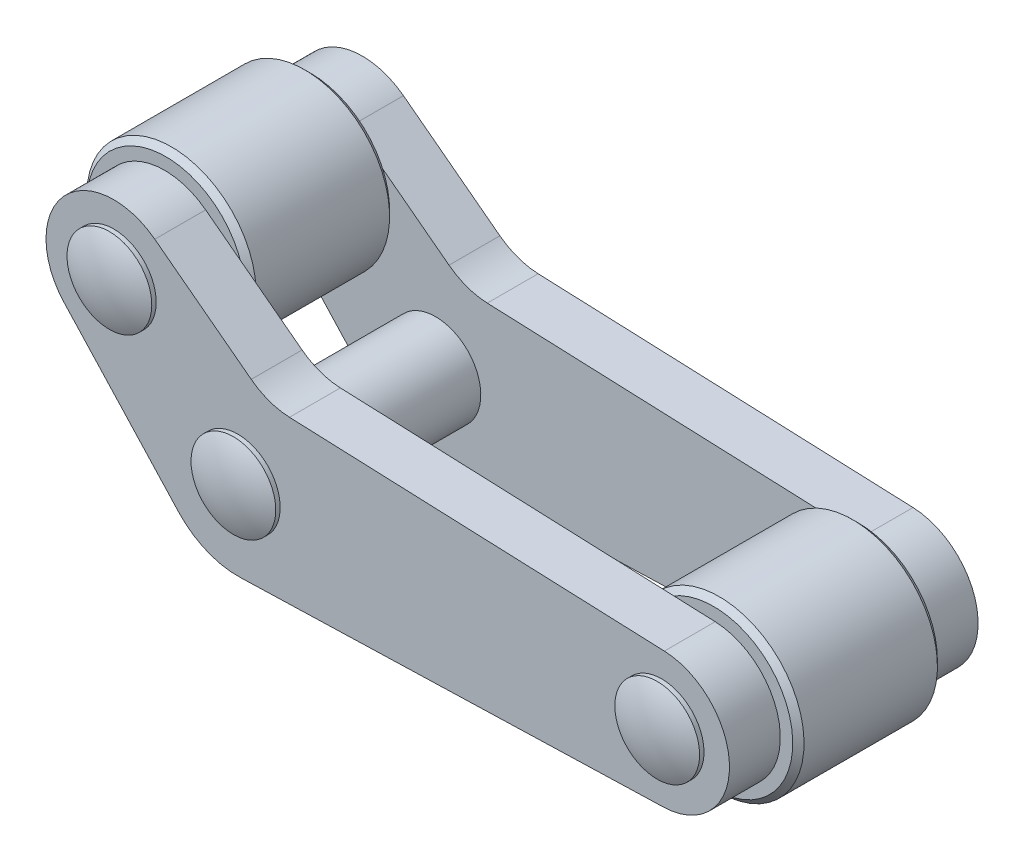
ISO-10303-21;
HEADER;
FILE_DESCRIPTION(('STEP AP214'),'2;1');
FILE_NAME('part.step','',(''),(''),'','','');
FILE_SCHEMA(('AUTOMOTIVE_DESIGN { 1 0 10303 214 1 1 1 1 }'));
ENDSEC;
DATA;
#1=APPLICATION_CONTEXT('core data for automotive mechanical design processes');
#2=APPLICATION_PROTOCOL_DEFINITION('international standard','automotive_design',2000,#1);
#3=PRODUCT_CONTEXT('',#1,'mechanical');
#4=PRODUCT('Part','Part','',(#3));
#5=PRODUCT_RELATED_PRODUCT_CATEGORY('part','',(#4));
#6=PRODUCT_DEFINITION_FORMATION('','',#4);
#7=PRODUCT_DEFINITION_CONTEXT('part definition',#1,'design');
#8=PRODUCT_DEFINITION('design','',#6,#7);
#9=PRODUCT_DEFINITION_SHAPE('','',#8);
#10=(LENGTH_UNIT() NAMED_UNIT(*) SI_UNIT(.MILLI.,.METRE.));
#11=(NAMED_UNIT(*) PLANE_ANGLE_UNIT() SI_UNIT($,.RADIAN.));
#12=(NAMED_UNIT(*) SI_UNIT($,.STERADIAN.) SOLID_ANGLE_UNIT());
#13=UNCERTAINTY_MEASURE_WITH_UNIT(LENGTH_MEASURE(1.E-05),#10,'distance_accuracy_value','');
#14=(GEOMETRIC_REPRESENTATION_CONTEXT(3) GLOBAL_UNCERTAINTY_ASSIGNED_CONTEXT((#13)) GLOBAL_UNIT_ASSIGNED_CONTEXT((#10,
#11,#12)) REPRESENTATION_CONTEXT('',''));
#15=CARTESIAN_POINT('',(0.,0.,0.));
#16=DIRECTION('',(0.,0.,1.));
#17=DIRECTION('',(1.,0.,0.));
#18=AXIS2_PLACEMENT_3D('',#15,#16,#17);
#19=CARTESIAN_POINT('',(27.,-0.3,10.9999999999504));
#20=DIRECTION('',(0.,0.,1.));
#21=DIRECTION('',(1.,0.,0.));
#22=AXIS2_PLACEMENT_3D('',#19,#20,#21);
#23=CONICAL_SURFACE('',#22,3.49999999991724,0.785398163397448);
#24=CARTESIAN_POINT('',(27.,-0.3,10.5));
#25=DIRECTION('',(0.,0.,-1.));
#26=DIRECTION('',(-1.,0.,0.));
#27=AXIS2_PLACEMENT_3D('',#24,#25,#26);
#28=CIRCLE('',#27,3.00000000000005);
#29=CARTESIAN_POINT('',(23.9999999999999,-0.3,10.5));
#30=VERTEX_POINT('',#29);
#31=EDGE_CURVE('P0_E137',#30,#30,#28,.T.);
#32=ORIENTED_EDGE('',*,*,#31,.T.);
#33=EDGE_LOOP('',(#32));
#34=FACE_BOUND('',#33,.T.);
#35=CARTESIAN_POINT('',(27.,-0.3,11.0000000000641));
#36=DIRECTION('',(0.,0.,1.));
#37=DIRECTION('',(1.,0.,0.));
#38=AXIS2_PLACEMENT_3D('',#35,#36,#37);
#39=CIRCLE('',#38,3.50000000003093);
#40=CARTESIAN_POINT('',(30.5000000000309,-0.3,11.0000000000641));
#41=VERTEX_POINT('',#40);
#42=EDGE_CURVE('P0_E19',#41,#41,#39,.T.);
#43=ORIENTED_EDGE('',*,*,#42,.T.);
#44=EDGE_LOOP('',(#43));
#45=FACE_BOUND('',#44,.T.);
#46=ADVANCED_FACE('P0_F16',(#34,#45),#23,.F.);
#47=CARTESIAN_POINT('',(-10.5,-0.3,10.9999999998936));
#48=DIRECTION('',(0.,0.,1.));
#49=DIRECTION('',(1.,0.,0.));
#50=AXIS2_PLACEMENT_3D('',#47,#48,#49);
#51=CONICAL_SURFACE('',#50,3.49999999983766,0.785398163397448);
#52=CARTESIAN_POINT('',(-10.5,-0.3,10.5));
#53=DIRECTION('',(0.,0.,-1.));
#54=DIRECTION('',(-1.,0.,0.));
#55=AXIS2_PLACEMENT_3D('',#52,#53,#54);
#56=CIRCLE('',#55,3.00000000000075);
#57=CARTESIAN_POINT('',(-13.5000000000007,-0.3,10.5));
#58=VERTEX_POINT('',#57);
#59=EDGE_CURVE('P0_E134',#58,#58,#56,.T.);
#60=ORIENTED_EDGE('',*,*,#59,.T.);
#61=EDGE_LOOP('',(#60));
#62=FACE_BOUND('',#61,.T.);
#63=CARTESIAN_POINT('',(-10.5,-0.3,10.9999999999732));
#64=DIRECTION('',(0.,0.,1.));
#65=DIRECTION('',(1.,0.,0.));
#66=AXIS2_PLACEMENT_3D('',#63,#64,#65);
#67=CIRCLE('',#66,3.49999999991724);
#68=CARTESIAN_POINT('',(-7.00000000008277,-0.3,10.9999999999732));
#69=VERTEX_POINT('',#68);
#70=EDGE_CURVE('P0_E164',#69,#69,#67,.T.);
#71=ORIENTED_EDGE('',*,*,#70,.T.);
#72=EDGE_LOOP('',(#71));
#73=FACE_BOUND('',#72,.T.);
#74=ADVANCED_FACE('P0_F186',(#62,#73),#51,.F.);
#75=CARTESIAN_POINT('',(-21.4703055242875,9.92997540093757,10.9999999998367));
#76=DIRECTION('',(0.,0.,1.));
#77=DIRECTION('',(1.,0.,0.));
#78=AXIS2_PLACEMENT_3D('',#75,#76,#77);
#79=CONICAL_SURFACE('',#78,3.49999999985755,0.785398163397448);
#80=CARTESIAN_POINT('',(-21.4703055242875,9.92997540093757,10.5));
#81=DIRECTION('',(0.,0.,-1.));
#82=DIRECTION('',(-1.,0.,0.));
#83=AXIS2_PLACEMENT_3D('',#80,#81,#82);
#84=CIRCLE('',#83,3.);
#85=CARTESIAN_POINT('',(-24.4703055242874,9.92997540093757,10.5));
#86=VERTEX_POINT('',#85);
#87=EDGE_CURVE('P0_E97',#86,#86,#84,.T.);
#88=ORIENTED_EDGE('',*,*,#87,.T.);
#89=EDGE_LOOP('',(#88));
#90=FACE_BOUND('',#89,.T.);
#91=CARTESIAN_POINT('',(-21.4703055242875,9.92997540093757,10.9999999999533));
#92=DIRECTION('',(0.,0.,1.));
#93=DIRECTION('',(1.,0.,0.));
#94=AXIS2_PLACEMENT_3D('',#91,#92,#93);
#95=CIRCLE('',#94,3.49999999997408);
#96=CARTESIAN_POINT('',(-17.9703055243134,9.92997540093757,10.9999999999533));
#97=VERTEX_POINT('',#96);
#98=EDGE_CURVE('P0_E139',#97,#97,#95,.T.);
#99=ORIENTED_EDGE('',*,*,#98,.T.);
#100=EDGE_LOOP('',(#99));
#101=FACE_BOUND('',#100,.T.);
#102=ADVANCED_FACE('P0_F174',(#90,#101),#79,.F.);
#103=CARTESIAN_POINT('',(27.,-0.3,11.));
#104=DIRECTION('',(0.,0.,-1.));
#105=DIRECTION('',(-1.,0.,0.));
#106=AXIS2_PLACEMENT_3D('',#103,#104,#105);
#107=PLANE('',#106);
#108=ORIENTED_EDGE('',*,*,#98,.F.);
#109=EDGE_LOOP('',(#108));
#110=FACE_BOUND('',#109,.T.);
#111=ORIENTED_EDGE('',*,*,#70,.F.);
#112=EDGE_LOOP('',(#111));
#113=FACE_BOUND('',#112,.T.);
#114=ORIENTED_EDGE('',*,*,#42,.F.);
#115=EDGE_LOOP('',(#114));
#116=FACE_BOUND('',#115,.T.);
#117=CARTESIAN_POINT('',(-5.68731943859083,13.02,11.));
#118=DIRECTION('',(0.,0.,-1.));
#119=DIRECTION('',(-1.,0.,0.));
#120=AXIS2_PLACEMENT_3D('',#117,#118,#119);
#121=CIRCLE('',#120,5.99999999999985);
#122=CARTESIAN_POINT('',(-5.92765301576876,7.02481528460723,11.));
#123=VERTEX_POINT('',#122);
#124=CARTESIAN_POINT('',(-9.31327265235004,8.2395749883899,11.));
#125=VERTEX_POINT('',#124);
#126=EDGE_CURVE('P0_E82',#123,#125,#121,.T.);
#127=ORIENTED_EDGE('',*,*,#126,.T.);
#128=DIRECTION('',(0.796737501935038,-0.604325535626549,0.));
#129=VECTOR('',#128,1.);
#130=CARTESIAN_POINT('',(-17.8443523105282,14.7104004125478,11.));
#131=LINE('',#130,#129);
#132=CARTESIAN_POINT('',(-17.8443523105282,14.7104004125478,11.));
#133=VERTEX_POINT('',#132);
#134=EDGE_CURVE('P0_E120',#133,#125,#131,.T.);
#135=ORIENTED_EDGE('',*,*,#134,.F.);
#136=CARTESIAN_POINT('',(-21.4703055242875,9.92997540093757,11.));
#137=DIRECTION('',(0.,0.,-1.));
#138=DIRECTION('',(-1.,0.,0.));
#139=AXIS2_PLACEMENT_3D('',#136,#137,#138);
#140=CIRCLE('',#139,6.);
#141=CARTESIAN_POINT('',(-25.8812397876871,5.86258570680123,11.));
#142=VERTEX_POINT('',#141);
#143=EDGE_CURVE('P0_E122',#142,#133,#140,.T.);
#144=ORIENTED_EDGE('',*,*,#143,.F.);
#145=DIRECTION('',(-0.677898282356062,0.735155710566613,0.));
#146=VECTOR('',#145,1.);
#147=CARTESIAN_POINT('',(-25.8812397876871,5.86258570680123,11.));
#148=LINE('',#147,#146);
#149=CARTESIAN_POINT('',(-15.7416602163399,-5.13341475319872,11.));
#150=VERTEX_POINT('',#149);
#151=EDGE_CURVE('P0_E123',#150,#142,#148,.T.);
#152=ORIENTED_EDGE('',*,*,#151,.F.);
#153=CARTESIAN_POINT('',(-10.5,-0.3,11.));
#154=DIRECTION('',(0.,0.,-1.));
#155=DIRECTION('',(-1.,0.,0.));
#156=AXIS2_PLACEMENT_3D('',#153,#154,#155);
#157=CIRCLE('',#156,7.13);
#158=CARTESIAN_POINT('',(-10.2851493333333,-7.4267621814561,11.));
#159=VERTEX_POINT('',#158);
#160=EDGE_CURVE('P0_E160',#159,#150,#157,.T.);
#161=ORIENTED_EDGE('',*,*,#160,.F.);
#162=DIRECTION('',(-0.999545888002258,-0.0301333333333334,0.));
#163=VECTOR('',#162,1.);
#164=CARTESIAN_POINT('',(27.1808,-6.29727532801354,11.));
#165=LINE('',#164,#163);
#166=CARTESIAN_POINT('',(27.1808,-6.29727532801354,11.));
#167=VERTEX_POINT('',#166);
#168=EDGE_CURVE('P0_E128',#167,#159,#165,.T.);
#169=ORIENTED_EDGE('',*,*,#168,.F.);
#170=CARTESIAN_POINT('',(27.,-0.3,11.));
#171=DIRECTION('',(0.,0.,-1.));
#172=DIRECTION('',(-1.,0.,0.));
#173=AXIS2_PLACEMENT_3D('',#170,#171,#172);
#174=CIRCLE('',#173,6.);
#175=CARTESIAN_POINT('',(27.240333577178,5.69518471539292,11.));
#176=VERTEX_POINT('',#175);
#177=EDGE_CURVE('P0_E85',#176,#167,#174,.T.);
#178=ORIENTED_EDGE('',*,*,#177,.F.);
#179=DIRECTION('',(0.999197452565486,-0.0400555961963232,0.));
#180=VECTOR('',#179,1.);
#181=CARTESIAN_POINT('',(27.240333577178,5.69518471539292,11.));
#182=LINE('',#181,#180);
#183=EDGE_CURVE('P0_E79',#123,#176,#182,.T.);
#184=ORIENTED_EDGE('',*,*,#183,.F.);
#185=EDGE_LOOP('',(#127,#135,#144,#152,#161,#169,#178,#184));
#186=FACE_BOUND('',#185,.T.);
#187=ADVANCED_FACE('P0_F81',(#110,#113,#116,#186),#107,.F.);
#188=CARTESIAN_POINT('',(27.,-0.3,11.));
#189=DIRECTION('',(0.,0.,-1.));
#190=DIRECTION('',(-1.,0.,0.));
#191=AXIS2_PLACEMENT_3D('',#188,#189,#190);
#192=CYLINDRICAL_SURFACE('',#191,3.00000000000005);
#193=ORIENTED_EDGE('',*,*,#31,.F.);
#194=EDGE_LOOP('',(#193));
#195=FACE_BOUND('',#194,.T.);
#196=CARTESIAN_POINT('',(27.,-0.3,6.99999999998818));
#197=DIRECTION('',(0.,0.,-1.));
#198=DIRECTION('',(-1.,0.,0.));
#199=AXIS2_PLACEMENT_3D('',#196,#197,#198);
#200=CIRCLE('',#199,2.99999999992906);
#201=CARTESIAN_POINT('',(24.0000000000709,-0.3,6.99999999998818));
#202=VERTEX_POINT('',#201);
#203=EDGE_CURVE('P0_E116',#202,#202,#200,.T.);
#204=ORIENTED_EDGE('',*,*,#203,.T.);
#205=EDGE_LOOP('',(#204));
#206=FACE_BOUND('',#205,.T.);
#207=ADVANCED_FACE('P0_F173',(#195,#206),#192,.F.);
#208=CARTESIAN_POINT('',(-10.5,-0.3,11.));
#209=DIRECTION('',(0.,0.,-1.));
#210=DIRECTION('',(-1.,0.,0.));
#211=AXIS2_PLACEMENT_3D('',#208,#209,#210);
#212=CYLINDRICAL_SURFACE('',#211,3.00000000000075);
#213=ORIENTED_EDGE('',*,*,#59,.F.);
#214=EDGE_LOOP('',(#213));
#215=FACE_BOUND('',#214,.T.);
#216=CARTESIAN_POINT('',(-10.5,-0.3,7.00000000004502));
#217=DIRECTION('',(0.,0.,-1.));
#218=DIRECTION('',(-1.,0.,0.));
#219=AXIS2_PLACEMENT_3D('',#216,#217,#218);
#220=CIRCLE('',#219,3.00000000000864);
#221=CARTESIAN_POINT('',(-13.5000000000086,-0.3,7.00000000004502));
#222=VERTEX_POINT('',#221);
#223=EDGE_CURVE('P0_E113',#222,#222,#220,.T.);
#224=ORIENTED_EDGE('',*,*,#223,.T.);
#225=EDGE_LOOP('',(#224));
#226=FACE_BOUND('',#225,.T.);
#227=ADVANCED_FACE('P0_F183',(#215,#226),#212,.F.);
#228=CARTESIAN_POINT('',(-21.4703055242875,9.92997540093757,11.));
#229=DIRECTION('',(0.,0.,-1.));
#230=DIRECTION('',(-1.,0.,0.));
#231=AXIS2_PLACEMENT_3D('',#228,#229,#230);
#232=CYLINDRICAL_SURFACE('',#231,3.);
#233=ORIENTED_EDGE('',*,*,#87,.F.);
#234=EDGE_LOOP('',(#233));
#235=FACE_BOUND('',#234,.T.);
#236=CARTESIAN_POINT('',(-21.4703055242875,9.92997540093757,6.99999999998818));
#237=DIRECTION('',(0.,0.,-1.));
#238=DIRECTION('',(-1.,0.,0.));
#239=AXIS2_PLACEMENT_3D('',#236,#237,#238);
#240=CIRCLE('',#239,3.00000000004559);
#241=CARTESIAN_POINT('',(-24.470305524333,9.92997540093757,6.99999999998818));
#242=VERTEX_POINT('',#241);
#243=EDGE_CURVE('P0_E109',#242,#242,#240,.T.);
#244=ORIENTED_EDGE('',*,*,#243,.T.);
#245=EDGE_LOOP('',(#244));
#246=FACE_BOUND('',#245,.T.);
#247=ADVANCED_FACE('P0_F240',(#235,#246),#232,.F.);
#248=CARTESIAN_POINT('',(-5.68731943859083,13.02,11.));
#249=DIRECTION('',(0.,0.,-1.));
#250=DIRECTION('',(-1.,0.,0.));
#251=AXIS2_PLACEMENT_3D('',#248,#249,#250);
#252=CYLINDRICAL_SURFACE('',#251,5.99999999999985);
#253=ORIENTED_EDGE('',*,*,#126,.F.);
#254=DIRECTION('',(0.,0.,-1.));
#255=VECTOR('',#254,1.);
#256=CARTESIAN_POINT('',(-5.92765301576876,7.02481528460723,11.));
#257=LINE('',#256,#255);
#258=CARTESIAN_POINT('',(-5.92765301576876,7.02481528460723,6.5));
#259=VERTEX_POINT('',#258);
#260=EDGE_CURVE('P0_E89',#259,#123,#257,.F.);
#261=ORIENTED_EDGE('',*,*,#260,.F.);
#262=CARTESIAN_POINT('',(-5.68731943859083,13.02,6.5));
#263=DIRECTION('',(0.,0.,-1.));
#264=DIRECTION('',(-1.,0.,0.));
#265=AXIS2_PLACEMENT_3D('',#262,#263,#264);
#266=CIRCLE('',#265,5.99999999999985);
#267=CARTESIAN_POINT('',(-9.31327265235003,8.2395749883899,6.5));
#268=VERTEX_POINT('',#267);
#269=EDGE_CURVE('P0_E112',#268,#259,#266,.F.);
#270=ORIENTED_EDGE('',*,*,#269,.F.);
#271=DIRECTION('',(0.,0.,-1.));
#272=VECTOR('',#271,1.);
#273=CARTESIAN_POINT('',(-9.31327265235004,8.2395749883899,11.));
#274=LINE('',#273,#272);
#275=EDGE_CURVE('P0_E95',#125,#268,#274,.T.);
#276=ORIENTED_EDGE('',*,*,#275,.F.);
#277=EDGE_LOOP('',(#253,#261,#270,#276));
#278=FACE_BOUND('',#277,.T.);
#279=ADVANCED_FACE('P0_F92',(#278),#252,.F.);
#280=CARTESIAN_POINT('',(27.240333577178,5.69518471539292,11.));
#281=DIRECTION('',(0.0400555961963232,0.999197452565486,0.));
#282=DIRECTION('',(0.999197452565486,-0.0400555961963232,0.));
#283=AXIS2_PLACEMENT_3D('',#280,#281,#282);
#284=PLANE('',#283);
#285=DIRECTION('',(0.999197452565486,-0.0400555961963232,0.));
#286=VECTOR('',#285,1.);
#287=CARTESIAN_POINT('',(-5.92765301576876,7.02481528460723,6.5));
#288=LINE('',#287,#286);
#289=CARTESIAN_POINT('',(27.240333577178,5.69518471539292,6.5));
#290=VERTEX_POINT('',#289);
#291=EDGE_CURVE('P0_E101',#259,#290,#288,.T.);
#292=ORIENTED_EDGE('',*,*,#291,.F.);
#293=ORIENTED_EDGE('',*,*,#260,.T.);
#294=ORIENTED_EDGE('',*,*,#183,.T.);
#295=DIRECTION('',(0.,0.,-1.));
#296=VECTOR('',#295,1.);
#297=CARTESIAN_POINT('',(27.240333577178,5.69518471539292,11.));
#298=LINE('',#297,#296);
#299=EDGE_CURVE('P0_E104',#290,#176,#298,.F.);
#300=ORIENTED_EDGE('',*,*,#299,.F.);
#301=EDGE_LOOP('',(#292,#293,#294,#300));
#302=FACE_BOUND('',#301,.T.);
#303=ADVANCED_FACE('P0_F99',(#302),#284,.T.);
#304=CARTESIAN_POINT('',(27.,-0.3,11.));
#305=DIRECTION('',(0.,0.,-1.));
#306=DIRECTION('',(-1.,0.,0.));
#307=AXIS2_PLACEMENT_3D('',#304,#305,#306);
#308=CYLINDRICAL_SURFACE('',#307,6.);
#309=CARTESIAN_POINT('',(27.,-0.3,6.5));
#310=DIRECTION('',(0.,0.,-1.));
#311=DIRECTION('',(-1.,0.,0.));
#312=AXIS2_PLACEMENT_3D('',#309,#310,#311);
#313=CIRCLE('',#312,6.);
#314=CARTESIAN_POINT('',(27.1808,-6.29727532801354,6.5));
#315=VERTEX_POINT('',#314);
#316=EDGE_CURVE('P0_E153',#290,#315,#313,.T.);
#317=ORIENTED_EDGE('',*,*,#316,.F.);
#318=ORIENTED_EDGE('',*,*,#299,.T.);
#319=ORIENTED_EDGE('',*,*,#177,.T.);
#320=DIRECTION('',(0.,0.,-1.));
#321=VECTOR('',#320,1.);
#322=CARTESIAN_POINT('',(27.1808,-6.29727532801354,11.));
#323=LINE('',#322,#321);
#324=EDGE_CURVE('P0_E130',#315,#167,#323,.F.);
#325=ORIENTED_EDGE('',*,*,#324,.F.);
#326=EDGE_LOOP('',(#317,#318,#319,#325));
#327=FACE_BOUND('',#326,.T.);
#328=ADVANCED_FACE('P0_F231',(#327),#308,.T.);
#329=CARTESIAN_POINT('',(27.1808,-6.29727532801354,11.));
#330=DIRECTION('',(0.0301333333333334,-0.999545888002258,0.));
#331=DIRECTION('',(-0.999545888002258,-0.0301333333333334,0.));
#332=AXIS2_PLACEMENT_3D('',#329,#330,#331);
#333=PLANE('',#332);
#334=DIRECTION('',(-0.999545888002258,-0.0301333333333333,0.));
#335=VECTOR('',#334,1.);
#336=CARTESIAN_POINT('',(27.1808,-6.29727532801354,6.5));
#337=LINE('',#336,#335);
#338=CARTESIAN_POINT('',(-10.2851493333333,-7.42676218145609,6.5));
#339=VERTEX_POINT('',#338);
#340=EDGE_CURVE('P0_E152',#315,#339,#337,.T.);
#341=ORIENTED_EDGE('',*,*,#340,.F.);
#342=ORIENTED_EDGE('',*,*,#324,.T.);
#343=ORIENTED_EDGE('',*,*,#168,.T.);
#344=DIRECTION('',(0.,0.,-1.));
#345=VECTOR('',#344,1.);
#346=CARTESIAN_POINT('',(-10.2851493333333,-7.42676218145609,11.));
#347=LINE('',#346,#345);
#348=EDGE_CURVE('P0_E127',#339,#159,#347,.F.);
#349=ORIENTED_EDGE('',*,*,#348,.F.);
#350=EDGE_LOOP('',(#341,#342,#343,#349));
#351=FACE_BOUND('',#350,.T.);
#352=ADVANCED_FACE('P0_F227',(#351),#333,.T.);
#353=CARTESIAN_POINT('',(-10.5,-0.3,11.));
#354=DIRECTION('',(0.,0.,-1.));
#355=DIRECTION('',(-1.,0.,0.));
#356=AXIS2_PLACEMENT_3D('',#353,#354,#355);
#357=CYLINDRICAL_SURFACE('',#356,7.13);
#358=CARTESIAN_POINT('',(-10.5,-0.3,6.5));
#359=DIRECTION('',(0.,0.,-1.));
#360=DIRECTION('',(-1.,0.,0.));
#361=AXIS2_PLACEMENT_3D('',#358,#359,#360);
#362=CIRCLE('',#361,7.13);
#363=CARTESIAN_POINT('',(-15.7416602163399,-5.13341475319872,6.5));
#364=VERTEX_POINT('',#363);
#365=EDGE_CURVE('P0_E149',#339,#364,#362,.T.);
#366=ORIENTED_EDGE('',*,*,#365,.F.);
#367=ORIENTED_EDGE('',*,*,#348,.T.);
#368=ORIENTED_EDGE('',*,*,#160,.T.);
#369=DIRECTION('',(0.,0.,-1.));
#370=VECTOR('',#369,1.);
#371=CARTESIAN_POINT('',(-15.7416602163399,-5.13341475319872,11.));
#372=LINE('',#371,#370);
#373=EDGE_CURVE('P0_E126',#364,#150,#372,.F.);
#374=ORIENTED_EDGE('',*,*,#373,.F.);
#375=EDGE_LOOP('',(#366,#367,#368,#374));
#376=FACE_BOUND('',#375,.T.);
#377=ADVANCED_FACE('P0_F223',(#376),#357,.T.);
#378=CARTESIAN_POINT('',(-25.8812397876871,5.86258570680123,11.));
#379=DIRECTION('',(-0.735155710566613,-0.677898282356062,0.));
#380=DIRECTION('',(-0.677898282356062,0.735155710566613,0.));
#381=AXIS2_PLACEMENT_3D('',#378,#379,#380);
#382=PLANE('',#381);
#383=DIRECTION('',(-0.677898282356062,0.735155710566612,0.));
#384=VECTOR('',#383,1.);
#385=CARTESIAN_POINT('',(-15.7416602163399,-5.13341475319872,6.5));
#386=LINE('',#385,#384);
#387=CARTESIAN_POINT('',(-25.8812397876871,5.86258570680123,6.5));
#388=VERTEX_POINT('',#387);
#389=EDGE_CURVE('P0_E148',#364,#388,#386,.T.);
#390=ORIENTED_EDGE('',*,*,#389,.F.);
#391=ORIENTED_EDGE('',*,*,#373,.T.);
#392=ORIENTED_EDGE('',*,*,#151,.T.);
#393=DIRECTION('',(0.,0.,-1.));
#394=VECTOR('',#393,1.);
#395=CARTESIAN_POINT('',(-25.8812397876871,5.86258570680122,11.));
#396=LINE('',#395,#394);
#397=EDGE_CURVE('P0_E159',#388,#142,#396,.F.);
#398=ORIENTED_EDGE('',*,*,#397,.F.);
#399=EDGE_LOOP('',(#390,#391,#392,#398));
#400=FACE_BOUND('',#399,.T.);
#401=ADVANCED_FACE('P0_F219',(#400),#382,.T.);
#402=CARTESIAN_POINT('',(-21.4703055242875,9.92997540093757,11.));
#403=DIRECTION('',(0.,0.,-1.));
#404=DIRECTION('',(-1.,0.,0.));
#405=AXIS2_PLACEMENT_3D('',#402,#403,#404);
#406=CYLINDRICAL_SURFACE('',#405,6.);
#407=DIRECTION('',(0.,0.,-1.));
#408=VECTOR('',#407,1.);
#409=CARTESIAN_POINT('',(-17.8443523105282,14.7104004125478,11.));
#410=LINE('',#409,#408);
#411=CARTESIAN_POINT('',(-17.8443523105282,14.7104004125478,6.5));
#412=VERTEX_POINT('',#411);
#413=EDGE_CURVE('P0_E119',#412,#133,#410,.F.);
#414=ORIENTED_EDGE('',*,*,#413,.F.);
#415=CARTESIAN_POINT('',(-21.4703055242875,9.92997540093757,6.5));
#416=DIRECTION('',(0.,0.,-1.));
#417=DIRECTION('',(-1.,0.,0.));
#418=AXIS2_PLACEMENT_3D('',#415,#416,#417);
#419=CIRCLE('',#418,6.);
#420=EDGE_CURVE('P0_E34',#388,#412,#419,.T.);
#421=ORIENTED_EDGE('',*,*,#420,.F.);
#422=ORIENTED_EDGE('',*,*,#397,.T.);
#423=ORIENTED_EDGE('',*,*,#143,.T.);
#424=EDGE_LOOP('',(#414,#421,#422,#423));
#425=FACE_BOUND('',#424,.T.);
#426=ADVANCED_FACE('P0_F215',(#425),#406,.T.);
#427=CARTESIAN_POINT('',(-17.8443523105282,14.7104004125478,11.));
#428=DIRECTION('',(0.604325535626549,0.796737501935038,0.));
#429=DIRECTION('',(0.796737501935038,-0.604325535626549,0.));
#430=AXIS2_PLACEMENT_3D('',#427,#428,#429);
#431=PLANE('',#430);
#432=DIRECTION('',(0.796737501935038,-0.604325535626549,0.));
#433=VECTOR('',#432,1.);
#434=CARTESIAN_POINT('',(-17.8443523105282,14.7104004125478,6.5));
#435=LINE('',#434,#433);
#436=EDGE_CURVE('P0_E146',#412,#268,#435,.T.);
#437=ORIENTED_EDGE('',*,*,#436,.F.);
#438=ORIENTED_EDGE('',*,*,#413,.T.);
#439=ORIENTED_EDGE('',*,*,#134,.T.);
#440=ORIENTED_EDGE('',*,*,#275,.T.);
#441=EDGE_LOOP('',(#437,#438,#439,#440));
#442=FACE_BOUND('',#441,.T.);
#443=ADVANCED_FACE('P0_F211',(#442),#431,.T.);
#444=CARTESIAN_POINT('',(27.,-0.3,6.5));
#445=DIRECTION('',(0.,0.,-1.));
#446=DIRECTION('',(-1.,0.,0.));
#447=AXIS2_PLACEMENT_3D('',#444,#445,#446);
#448=CONICAL_SURFACE('',#447,3.4999999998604,0.785398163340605);
#449=ORIENTED_EDGE('',*,*,#203,.F.);
#450=EDGE_LOOP('',(#449));
#451=FACE_BOUND('',#450,.T.);
#452=CARTESIAN_POINT('',(27.,-0.3,6.49999999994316));
#453=DIRECTION('',(0.,0.,-1.));
#454=DIRECTION('',(-1.,0.,0.));
#455=AXIS2_PLACEMENT_3D('',#452,#453,#454);
#456=CIRCLE('',#455,3.49999999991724);
#457=CARTESIAN_POINT('',(23.5000000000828,-0.3,6.49999999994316));
#458=VERTEX_POINT('',#457);
#459=EDGE_CURVE('P0_E143',#458,#458,#456,.F.);
#460=ORIENTED_EDGE('',*,*,#459,.F.);
#461=EDGE_LOOP('',(#460));
#462=FACE_BOUND('',#461,.T.);
#463=ADVANCED_FACE('P0_F207',(#451,#462),#448,.F.);
#464=CARTESIAN_POINT('',(-10.5,-0.3,6.50000000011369));
#465=DIRECTION('',(0.,0.,-1.));
#466=DIRECTION('',(-1.,0.,0.));
#467=AXIS2_PLACEMENT_3D('',#464,#465,#466);
#468=CONICAL_SURFACE('',#467,3.49999999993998,0.785398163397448);
#469=ORIENTED_EDGE('',*,*,#223,.F.);
#470=EDGE_LOOP('',(#469));
#471=FACE_BOUND('',#470,.T.);
#472=CARTESIAN_POINT('',(-10.5,-0.3,6.50000000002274));
#473=DIRECTION('',(0.,0.,-1.));
#474=DIRECTION('',(-1.,0.,0.));
#475=AXIS2_PLACEMENT_3D('',#472,#473,#474);
#476=CIRCLE('',#475,3.50000000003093);
#477=CARTESIAN_POINT('',(-14.0000000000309,-0.3,6.50000000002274));
#478=VERTEX_POINT('',#477);
#479=EDGE_CURVE('P0_E25',#478,#478,#476,.F.);
#480=ORIENTED_EDGE('',*,*,#479,.F.);
#481=EDGE_LOOP('',(#480));
#482=FACE_BOUND('',#481,.T.);
#483=ADVANCED_FACE('P0_F200',(#471,#482),#468,.F.);
#484=CARTESIAN_POINT('',(-21.4703055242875,9.92997540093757,6.50000000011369));
#485=DIRECTION('',(0.,0.,-1.));
#486=DIRECTION('',(-1.,0.,0.));
#487=AXIS2_PLACEMENT_3D('',#484,#485,#486);
#488=CONICAL_SURFACE('',#487,3.49999999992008,0.785398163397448);
#489=ORIENTED_EDGE('',*,*,#243,.F.);
#490=EDGE_LOOP('',(#489));
#491=FACE_BOUND('',#490,.T.);
#492=CARTESIAN_POINT('',(-21.4703055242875,9.92997540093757,6.50000000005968));
#493=DIRECTION('',(0.,0.,-1.));
#494=DIRECTION('',(-1.,0.,0.));
#495=AXIS2_PLACEMENT_3D('',#492,#493,#494);
#496=CIRCLE('',#495,3.49999999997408);
#497=CARTESIAN_POINT('',(-24.9703055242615,9.92997540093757,6.50000000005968));
#498=VERTEX_POINT('',#497);
#499=EDGE_CURVE('P0_E11',#498,#498,#496,.F.);
#500=ORIENTED_EDGE('',*,*,#499,.F.);
#501=EDGE_LOOP('',(#500));
#502=FACE_BOUND('',#501,.T.);
#503=ADVANCED_FACE('P0_F193',(#491,#502),#488,.F.);
#504=CARTESIAN_POINT('',(27.,-0.3,6.5));
#505=DIRECTION('',(0.,0.,-1.));
#506=DIRECTION('',(-1.,0.,0.));
#507=AXIS2_PLACEMENT_3D('',#504,#505,#506);
#508=PLANE('',#507);
#509=ORIENTED_EDGE('',*,*,#499,.T.);
#510=EDGE_LOOP('',(#509));
#511=FACE_BOUND('',#510,.T.);
#512=ORIENTED_EDGE('',*,*,#479,.T.);
#513=EDGE_LOOP('',(#512));
#514=FACE_BOUND('',#513,.T.);
#515=ORIENTED_EDGE('',*,*,#459,.T.);
#516=EDGE_LOOP('',(#515));
#517=FACE_BOUND('',#516,.T.);
#518=ORIENTED_EDGE('',*,*,#420,.T.);
#519=ORIENTED_EDGE('',*,*,#436,.T.);
#520=ORIENTED_EDGE('',*,*,#269,.T.);
#521=ORIENTED_EDGE('',*,*,#291,.T.);
#522=ORIENTED_EDGE('',*,*,#316,.T.);
#523=ORIENTED_EDGE('',*,*,#340,.T.);
#524=ORIENTED_EDGE('',*,*,#365,.T.);
#525=ORIENTED_EDGE('',*,*,#389,.T.);
#526=EDGE_LOOP('',(#518,#519,#520,#521,#522,#523,#524,#525));
#527=FACE_BOUND('',#526,.T.);
#528=ADVANCED_FACE('P0_F191',(#511,#514,#517,#527),#508,.T.);
#529=CLOSED_SHELL('',(#46,#74,#102,#187,#207,#227,#247,#279,#303,#328,#352,#377,#401,#426,#443,
#463,#483,#503,#528));
#530=MANIFOLD_SOLID_BREP('P0_B1',#529);
#531=CARTESIAN_POINT('',(-10.5,-0.3,3.63585811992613));
#532=DIRECTION('',(0.95745949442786,-0.288567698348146,0.));
#533=DIRECTION('',(0.1263239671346,0.419139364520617,0.899090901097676));
#534=AXIS2_PLACEMENT_3D('',#531,#532,#533);
#535=SPHERICAL_SURFACE('',#534,8.61414188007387);
#536=CARTESIAN_POINT('',(-10.5,-0.3,3.63585811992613));
#537=DIRECTION('',(0.,0.,-1.));
#538=DIRECTION('',(0.288567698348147,0.95745949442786,0.));
#539=AXIS2_PLACEMENT_3D('',#536,#537,#538);
#540=SPHERICAL_SURFACE('',#539,8.61414188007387);
#541=CARTESIAN_POINT('',(-10.5,-0.3,11.3909171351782));
#542=DIRECTION('',(0.,0.,-1.));
#543=DIRECTION('',(0.288567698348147,0.95745949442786,0.));
#544=AXIS2_PLACEMENT_3D('',#541,#542,#543);
#545=CIRCLE('',#544,3.75);
#546=CARTESIAN_POINT('',(-9.41787113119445,3.29047310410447,11.3909171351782));
#547=VERTEX_POINT('',#546);
#548=EDGE_CURVE('P1_E18',#547,#547,#545,.T.);
#549=ORIENTED_EDGE('',*,*,#548,.F.);
#550=EDGE_LOOP('',(#549));
#551=FACE_BOUND('',#550,.T.);
#552=ADVANCED_FACE('P1_F14',(#551),#540,.T.);
#553=CARTESIAN_POINT('',(-10.5,-0.3,-3.63585811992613));
#554=DIRECTION('',(0.957459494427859,-0.288567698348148,0.));
#555=DIRECTION('',(-0.126323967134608,-0.419139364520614,-0.899090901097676));
#556=AXIS2_PLACEMENT_3D('',#553,#554,#555);
#557=SPHERICAL_SURFACE('',#556,8.61414188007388);
#558=CARTESIAN_POINT('',(-10.5,-0.3,-3.63585811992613));
#559=DIRECTION('',(0.,0.,1.));
#560=DIRECTION('',(-0.288567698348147,-0.95745949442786,0.));
#561=AXIS2_PLACEMENT_3D('',#558,#559,#560);
#562=SPHERICAL_SURFACE('',#561,8.61414188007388);
#563=CARTESIAN_POINT('',(-10.5,-0.3,-11.3909171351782));
#564=DIRECTION('',(0.,0.,1.));
#565=DIRECTION('',(-0.288567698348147,-0.95745949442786,0.));
#566=AXIS2_PLACEMENT_3D('',#563,#564,#565);
#567=CIRCLE('',#566,3.75);
#568=CARTESIAN_POINT('',(-11.5821288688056,-3.89047310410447,-11.3909171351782));
#569=VERTEX_POINT('',#568);
#570=EDGE_CURVE('P1_E44',#569,#569,#567,.T.);
#571=ORIENTED_EDGE('',*,*,#570,.F.);
#572=EDGE_LOOP('',(#571));
#573=FACE_BOUND('',#572,.T.);
#574=ADVANCED_FACE('P1_F55',(#573),#562,.T.);
#575=CARTESIAN_POINT('',(-10.5,-0.3,11.));
#576=DIRECTION('',(0.,0.,-1.));
#577=DIRECTION('',(0.288567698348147,0.95745949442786,0.));
#578=AXIS2_PLACEMENT_3D('',#575,#576,#577);
#579=CYLINDRICAL_SURFACE('',#578,3.75);
#580=ORIENTED_EDGE('',*,*,#548,.T.);
#581=EDGE_LOOP('',(#580));
#582=FACE_BOUND('',#581,.T.);
#583=CARTESIAN_POINT('',(-10.5,-0.3,11.));
#584=DIRECTION('',(0.,0.,-1.));
#585=DIRECTION('',(0.288567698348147,0.95745949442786,0.));
#586=AXIS2_PLACEMENT_3D('',#583,#584,#585);
#587=CIRCLE('',#586,3.75);
#588=CARTESIAN_POINT('',(-9.41787113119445,3.29047310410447,11.));
#589=VERTEX_POINT('',#588);
#590=EDGE_CURVE('P1_E42',#589,#589,#587,.F.);
#591=ORIENTED_EDGE('',*,*,#590,.T.);
#592=EDGE_LOOP('',(#591));
#593=FACE_BOUND('',#592,.T.);
#594=ADVANCED_FACE('P1_F51',(#582,#593),#579,.T.);
#595=CARTESIAN_POINT('',(-10.5,-0.3,-11.));
#596=DIRECTION('',(0.,0.,1.));
#597=DIRECTION('',(-0.288567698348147,-0.95745949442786,0.));
#598=AXIS2_PLACEMENT_3D('',#595,#596,#597);
#599=CYLINDRICAL_SURFACE('',#598,3.75);
#600=ORIENTED_EDGE('',*,*,#570,.T.);
#601=EDGE_LOOP('',(#600));
#602=FACE_BOUND('',#601,.T.);
#603=CARTESIAN_POINT('',(-10.5,-0.3,-11.));
#604=DIRECTION('',(0.,0.,1.));
#605=DIRECTION('',(-0.288567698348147,-0.95745949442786,0.));
#606=AXIS2_PLACEMENT_3D('',#603,#604,#605);
#607=CIRCLE('',#606,3.75);
#608=CARTESIAN_POINT('',(-11.5821288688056,-3.89047310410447,-11.));
#609=VERTEX_POINT('',#608);
#610=EDGE_CURVE('P1_E39',#609,#609,#607,.F.);
#611=ORIENTED_EDGE('',*,*,#610,.T.);
#612=EDGE_LOOP('',(#611));
#613=FACE_BOUND('',#612,.T.);
#614=ADVANCED_FACE('P1_F97',(#602,#613),#599,.T.);
#615=CARTESIAN_POINT('',(-14.0904731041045,0.782128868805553,11.));
#616=DIRECTION('',(0.,0.,1.));
#617=DIRECTION('',(-0.288567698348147,-0.95745949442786,0.));
#618=AXIS2_PLACEMENT_3D('',#615,#616,#617);
#619=PLANE('',#618);
#620=ORIENTED_EDGE('',*,*,#590,.F.);
#621=EDGE_LOOP('',(#620));
#622=FACE_BOUND('',#621,.T.);
#623=CARTESIAN_POINT('',(-10.5,-0.3,11.));
#624=DIRECTION('',(0.,0.,-1.));
#625=DIRECTION('',(0.288567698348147,0.95745949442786,0.));
#626=AXIS2_PLACEMENT_3D('',#623,#624,#625);
#627=CIRCLE('',#626,3.);
#628=CARTESIAN_POINT('',(-9.63429690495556,2.57237848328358,11.));
#629=VERTEX_POINT('',#628);
#630=EDGE_CURVE('P1_E36',#629,#629,#627,.T.);
#631=ORIENTED_EDGE('',*,*,#630,.F.);
#632=EDGE_LOOP('',(#631));
#633=FACE_BOUND('',#632,.T.);
#634=ADVANCED_FACE('P1_F93',(#622,#633),#619,.F.);
#635=CARTESIAN_POINT('',(-14.0904731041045,0.782128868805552,-11.));
#636=DIRECTION('',(0.,0.,-1.));
#637=DIRECTION('',(0.288567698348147,0.95745949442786,0.));
#638=AXIS2_PLACEMENT_3D('',#635,#636,#637);
#639=PLANE('',#638);
#640=ORIENTED_EDGE('',*,*,#610,.F.);
#641=EDGE_LOOP('',(#640));
#642=FACE_BOUND('',#641,.T.);
#643=CARTESIAN_POINT('',(-10.5,-0.3,-11.));
#644=DIRECTION('',(0.,0.,-1.));
#645=DIRECTION('',(0.288567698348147,0.95745949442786,0.));
#646=AXIS2_PLACEMENT_3D('',#643,#644,#645);
#647=CIRCLE('',#646,3.);
#648=CARTESIAN_POINT('',(-9.63429690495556,2.57237848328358,-11.));
#649=VERTEX_POINT('',#648);
#650=EDGE_CURVE('P1_E32',#649,#649,#647,.F.);
#651=ORIENTED_EDGE('',*,*,#650,.F.);
#652=EDGE_LOOP('',(#651));
#653=FACE_BOUND('',#652,.T.);
#654=ADVANCED_FACE('P1_F89',(#642,#653),#639,.F.);
#655=CARTESIAN_POINT('',(-10.5,-0.3,-12.5));
#656=DIRECTION('',(0.,0.,-1.));
#657=DIRECTION('',(0.288567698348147,0.95745949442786,0.));
#658=AXIS2_PLACEMENT_3D('',#655,#656,#657);
#659=CYLINDRICAL_SURFACE('',#658,3.);
#660=ORIENTED_EDGE('',*,*,#630,.T.);
#661=EDGE_LOOP('',(#660));
#662=FACE_BOUND('',#661,.T.);
#663=CARTESIAN_POINT('',(-10.5,-0.3,7.));
#664=DIRECTION('',(0.,0.,1.));
#665=DIRECTION('',(-0.288567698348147,-0.95745949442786,0.));
#666=AXIS2_PLACEMENT_3D('',#663,#664,#665);
#667=CIRCLE('',#666,3.);
#668=CARTESIAN_POINT('',(-11.3657030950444,-3.17237848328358,7.));
#669=VERTEX_POINT('',#668);
#670=EDGE_CURVE('P1_E35',#669,#669,#667,.T.);
#671=ORIENTED_EDGE('',*,*,#670,.T.);
#672=EDGE_LOOP('',(#671));
#673=FACE_BOUND('',#672,.T.);
#674=ADVANCED_FACE('P1_F85',(#662,#673),#659,.T.);
#675=CARTESIAN_POINT('',(-10.5,-0.3,-12.5));
#676=DIRECTION('',(0.,0.,-1.));
#677=DIRECTION('',(0.288567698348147,0.95745949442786,0.));
#678=AXIS2_PLACEMENT_3D('',#675,#676,#677);
#679=CYLINDRICAL_SURFACE('',#678,3.);
#680=CARTESIAN_POINT('',(-10.5,-0.3,-7.));
#681=DIRECTION('',(0.,0.,-1.));
#682=DIRECTION('',(-0.288567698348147,-0.95745949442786,0.));
#683=AXIS2_PLACEMENT_3D('',#680,#681,#682);
#684=CIRCLE('',#683,3.);
#685=CARTESIAN_POINT('',(-11.3657030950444,-3.17237848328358,-7.));
#686=VERTEX_POINT('',#685);
#687=EDGE_CURVE('P1_E221',#686,#686,#684,.T.);
#688=ORIENTED_EDGE('',*,*,#687,.T.);
#689=EDGE_LOOP('',(#688));
#690=FACE_BOUND('',#689,.T.);
#691=ORIENTED_EDGE('',*,*,#650,.T.);
#692=EDGE_LOOP('',(#691));
#693=FACE_BOUND('',#692,.T.);
#694=ADVANCED_FACE('P1_F81',(#690,#693),#679,.T.);
#695=CARTESIAN_POINT('',(-10.5,-0.3,7.));
#696=DIRECTION('',(0.,0.,-1.));
#697=DIRECTION('',(0.288567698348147,0.95745949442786,0.));
#698=AXIS2_PLACEMENT_3D('',#695,#696,#697);
#699=TOROIDAL_SURFACE('',#698,3.5,0.5);
#700=ORIENTED_EDGE('',*,*,#670,.F.);
#701=EDGE_LOOP('',(#700));
#702=FACE_BOUND('',#701,.T.);
#703=CARTESIAN_POINT('',(-10.5,-0.3,6.5));
#704=DIRECTION('',(0.,0.,-1.));
#705=DIRECTION('',(0.288567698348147,0.95745949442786,0.));
#706=AXIS2_PLACEMENT_3D('',#703,#704,#705);
#707=CIRCLE('',#706,3.5);
#708=CARTESIAN_POINT('',(-9.49001305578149,3.05110823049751,6.5));
#709=VERTEX_POINT('',#708);
#710=EDGE_CURVE('P1_E222',#709,#709,#707,.F.);
#711=ORIENTED_EDGE('',*,*,#710,.T.);
#712=EDGE_LOOP('',(#711));
#713=FACE_BOUND('',#712,.T.);
#714=ADVANCED_FACE('P1_F84',(#702,#713),#699,.F.);
#715=CARTESIAN_POINT('',(-10.5,-0.3,-7.));
#716=DIRECTION('',(0.,0.,-1.));
#717=DIRECTION('',(0.288567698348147,0.95745949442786,0.));
#718=AXIS2_PLACEMENT_3D('',#715,#716,#717);
#719=TOROIDAL_SURFACE('',#718,3.5,0.5);
#720=CARTESIAN_POINT('',(-10.5,-0.3,-6.5));
#721=DIRECTION('',(0.,0.,-1.));
#722=DIRECTION('',(0.288567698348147,0.95745949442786,0.));
#723=AXIS2_PLACEMENT_3D('',#720,#721,#722);
#724=CIRCLE('',#723,3.5);
#725=CARTESIAN_POINT('',(-9.49001305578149,3.05110823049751,-6.5));
#726=VERTEX_POINT('',#725);
#727=EDGE_CURVE('P1_E27',#726,#726,#724,.T.);
#728=ORIENTED_EDGE('',*,*,#727,.T.);
#729=EDGE_LOOP('',(#728));
#730=FACE_BOUND('',#729,.T.);
#731=ORIENTED_EDGE('',*,*,#687,.F.);
#732=EDGE_LOOP('',(#731));
#733=FACE_BOUND('',#732,.T.);
#734=ADVANCED_FACE('P1_F16',(#730,#733),#719,.F.);
#735=CARTESIAN_POINT('',(-13.8511082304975,0.709986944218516,6.5));
#736=DIRECTION('',(0.,0.,-1.));
#737=DIRECTION('',(0.288567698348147,0.95745949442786,0.));
#738=AXIS2_PLACEMENT_3D('',#735,#736,#737);
#739=PLANE('',#738);
#740=CARTESIAN_POINT('',(-10.5,-0.3,6.5));
#741=DIRECTION('',(0.,0.,-1.));
#742=DIRECTION('',(0.288567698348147,0.95745949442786,0.));
#743=AXIS2_PLACEMENT_3D('',#740,#741,#742);
#744=CIRCLE('',#743,4.);
#745=CARTESIAN_POINT('',(-9.34572920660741,3.52983797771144,6.5));
#746=VERTEX_POINT('',#745);
#747=EDGE_CURVE('P1_E22',#746,#746,#744,.T.);
#748=ORIENTED_EDGE('',*,*,#747,.F.);
#749=EDGE_LOOP('',(#748));
#750=FACE_BOUND('',#749,.T.);
#751=ORIENTED_EDGE('',*,*,#710,.F.);
#752=EDGE_LOOP('',(#751));
#753=FACE_BOUND('',#752,.T.);
#754=ADVANCED_FACE('P1_F73',(#750,#753),#739,.F.);
#755=CARTESIAN_POINT('',(-14.3298379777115,0.854270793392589,-6.5));
#756=DIRECTION('',(0.,0.,1.));
#757=DIRECTION('',(-0.288567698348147,-0.95745949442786,0.));
#758=AXIS2_PLACEMENT_3D('',#755,#756,#757);
#759=PLANE('',#758);
#760=ORIENTED_EDGE('',*,*,#727,.F.);
#761=EDGE_LOOP('',(#760));
#762=FACE_BOUND('',#761,.T.);
#763=CARTESIAN_POINT('',(-10.5,-0.3,-6.5));
#764=DIRECTION('',(0.,0.,-1.));
#765=DIRECTION('',(0.288567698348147,0.95745949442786,0.));
#766=AXIS2_PLACEMENT_3D('',#763,#764,#765);
#767=CIRCLE('',#766,4.);
#768=CARTESIAN_POINT('',(-9.34572920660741,3.52983797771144,-6.5));
#769=VERTEX_POINT('',#768);
#770=EDGE_CURVE('P1_E10',#769,#769,#767,.F.);
#771=ORIENTED_EDGE('',*,*,#770,.F.);
#772=EDGE_LOOP('',(#771));
#773=FACE_BOUND('',#772,.T.);
#774=ADVANCED_FACE('P1_F67',(#762,#773),#759,.F.);
#775=CARTESIAN_POINT('',(-10.5,-0.3,-12.5));
#776=DIRECTION('',(0.,0.,-1.));
#777=DIRECTION('',(0.288567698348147,0.95745949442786,0.));
#778=AXIS2_PLACEMENT_3D('',#775,#776,#777);
#779=CYLINDRICAL_SURFACE('',#778,4.);
#780=ORIENTED_EDGE('',*,*,#770,.T.);
#781=EDGE_LOOP('',(#780));
#782=FACE_BOUND('',#781,.T.);
#783=ORIENTED_EDGE('',*,*,#747,.T.);
#784=EDGE_LOOP('',(#783));
#785=FACE_BOUND('',#784,.T.);
#786=ADVANCED_FACE('P1_F65',(#782,#785),#779,.T.);
#787=CLOSED_SHELL('',(#552,#574,#594,#614,#634,#654,#674,#694,#714,#734,#754,#774,#786));
#788=MANIFOLD_SOLID_BREP('P1_B1',#787);
#789=CARTESIAN_POINT('',(-21.4703055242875,9.92997540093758,3.63585811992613));
#790=DIRECTION('',(-0.856297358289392,0.516483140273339,0.));
#791=DIRECTION('',(-0.226096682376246,-0.374854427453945,0.899090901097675));
#792=AXIS2_PLACEMENT_3D('',#789,#790,#791);
#793=SPHERICAL_SURFACE('',#792,8.61414188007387);
#794=CARTESIAN_POINT('',(-21.4703055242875,9.92997540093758,3.63585811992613));
#795=DIRECTION('',(0.,0.,-1.));
#796=DIRECTION('',(-0.51648314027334,-0.856297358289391,0.));
#797=AXIS2_PLACEMENT_3D('',#794,#795,#796);
#798=SPHERICAL_SURFACE('',#797,8.61414188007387);
#799=CARTESIAN_POINT('',(-21.4703055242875,9.92997540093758,11.3909171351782));
#800=DIRECTION('',(0.,0.,-1.));
#801=DIRECTION('',(-0.51648314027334,-0.856297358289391,0.));
#802=AXIS2_PLACEMENT_3D('',#799,#800,#801);
#803=CIRCLE('',#802,3.75);
#804=CARTESIAN_POINT('',(-23.4071173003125,6.71886030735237,11.3909171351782));
#805=VERTEX_POINT('',#804);
#806=EDGE_CURVE('P2_E18',#805,#805,#803,.T.);
#807=ORIENTED_EDGE('',*,*,#806,.F.);
#808=EDGE_LOOP('',(#807));
#809=FACE_BOUND('',#808,.T.);
#810=ADVANCED_FACE('P2_F14',(#809),#798,.T.);
#811=CARTESIAN_POINT('',(-21.4703055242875,9.92997540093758,-3.63585811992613));
#812=DIRECTION('',(-0.856297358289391,0.516483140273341,0.));
#813=DIRECTION('',(0.226096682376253,0.37485442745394,-0.899090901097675));
#814=AXIS2_PLACEMENT_3D('',#811,#812,#813);
#815=SPHERICAL_SURFACE('',#814,8.61414188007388);
#816=CARTESIAN_POINT('',(-21.4703055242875,9.92997540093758,-3.63585811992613));
#817=DIRECTION('',(0.,0.,1.));
#818=DIRECTION('',(0.51648314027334,0.856297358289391,0.));
#819=AXIS2_PLACEMENT_3D('',#816,#817,#818);
#820=SPHERICAL_SURFACE('',#819,8.61414188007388);
#821=CARTESIAN_POINT('',(-21.4703055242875,9.92997540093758,-11.3909171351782));
#822=DIRECTION('',(0.,0.,1.));
#823=DIRECTION('',(0.51648314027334,0.856297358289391,0.));
#824=AXIS2_PLACEMENT_3D('',#821,#822,#823);
#825=CIRCLE('',#824,3.75);
#826=CARTESIAN_POINT('',(-19.5334937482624,13.1410904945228,-11.3909171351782));
#827=VERTEX_POINT('',#826);
#828=EDGE_CURVE('P2_E44',#827,#827,#825,.T.);
#829=ORIENTED_EDGE('',*,*,#828,.F.);
#830=EDGE_LOOP('',(#829));
#831=FACE_BOUND('',#830,.T.);
#832=ADVANCED_FACE('P2_F55',(#831),#820,.T.);
#833=CARTESIAN_POINT('',(-21.4703055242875,9.92997540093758,11.));
#834=DIRECTION('',(0.,0.,-1.));
#835=DIRECTION('',(-0.51648314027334,-0.856297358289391,0.));
#836=AXIS2_PLACEMENT_3D('',#833,#834,#835);
#837=CYLINDRICAL_SURFACE('',#836,3.75);
#838=ORIENTED_EDGE('',*,*,#806,.T.);
#839=EDGE_LOOP('',(#838));
#840=FACE_BOUND('',#839,.T.);
#841=CARTESIAN_POINT('',(-21.4703055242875,9.92997540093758,11.));
#842=DIRECTION('',(0.,0.,-1.));
#843=DIRECTION('',(-0.51648314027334,-0.856297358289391,0.));
#844=AXIS2_PLACEMENT_3D('',#841,#842,#843);
#845=CIRCLE('',#844,3.75);
#846=CARTESIAN_POINT('',(-23.4071173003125,6.71886030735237,11.));
#847=VERTEX_POINT('',#846);
#848=EDGE_CURVE('P2_E42',#847,#847,#845,.F.);
#849=ORIENTED_EDGE('',*,*,#848,.T.);
#850=EDGE_LOOP('',(#849));
#851=FACE_BOUND('',#850,.T.);
#852=ADVANCED_FACE('P2_F51',(#840,#851),#837,.T.);
#853=CARTESIAN_POINT('',(-21.4703055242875,9.92997540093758,-11.));
#854=DIRECTION('',(0.,0.,1.));
#855=DIRECTION('',(0.51648314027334,0.856297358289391,0.));
#856=AXIS2_PLACEMENT_3D('',#853,#854,#855);
#857=CYLINDRICAL_SURFACE('',#856,3.75);
#858=ORIENTED_EDGE('',*,*,#828,.T.);
#859=EDGE_LOOP('',(#858));
#860=FACE_BOUND('',#859,.T.);
#861=CARTESIAN_POINT('',(-21.4703055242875,9.92997540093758,-11.));
#862=DIRECTION('',(0.,0.,1.));
#863=DIRECTION('',(0.51648314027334,0.856297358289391,0.));
#864=AXIS2_PLACEMENT_3D('',#861,#862,#863);
#865=CIRCLE('',#864,3.75);
#866=CARTESIAN_POINT('',(-19.5334937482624,13.1410904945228,-11.));
#867=VERTEX_POINT('',#866);
#868=EDGE_CURVE('P2_E39',#867,#867,#865,.F.);
#869=ORIENTED_EDGE('',*,*,#868,.T.);
#870=EDGE_LOOP('',(#869));
#871=FACE_BOUND('',#870,.T.);
#872=ADVANCED_FACE('P2_F97',(#860,#871),#857,.T.);
#873=CARTESIAN_POINT('',(-18.2591904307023,7.99316362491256,11.));
#874=DIRECTION('',(0.,0.,1.));
#875=DIRECTION('',(0.51648314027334,0.856297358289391,0.));
#876=AXIS2_PLACEMENT_3D('',#873,#874,#875);
#877=PLANE('',#876);
#878=ORIENTED_EDGE('',*,*,#848,.F.);
#879=EDGE_LOOP('',(#878));
#880=FACE_BOUND('',#879,.T.);
#881=CARTESIAN_POINT('',(-21.4703055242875,9.92997540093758,11.));
#882=DIRECTION('',(0.,0.,-1.));
#883=DIRECTION('',(-0.51648314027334,-0.856297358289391,0.));
#884=AXIS2_PLACEMENT_3D('',#881,#882,#883);
#885=CIRCLE('',#884,3.);
#886=CARTESIAN_POINT('',(-23.0197549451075,7.36108332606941,11.));
#887=VERTEX_POINT('',#886);
#888=EDGE_CURVE('P2_E36',#887,#887,#885,.T.);
#889=ORIENTED_EDGE('',*,*,#888,.F.);
#890=EDGE_LOOP('',(#889));
#891=FACE_BOUND('',#890,.T.);
#892=ADVANCED_FACE('P2_F93',(#880,#891),#877,.F.);
#893=CARTESIAN_POINT('',(-18.2591904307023,7.99316362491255,-11.));
#894=DIRECTION('',(0.,0.,-1.));
#895=DIRECTION('',(-0.51648314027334,-0.856297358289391,0.));
#896=AXIS2_PLACEMENT_3D('',#893,#894,#895);
#897=PLANE('',#896);
#898=ORIENTED_EDGE('',*,*,#868,.F.);
#899=EDGE_LOOP('',(#898));
#900=FACE_BOUND('',#899,.T.);
#901=CARTESIAN_POINT('',(-21.4703055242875,9.92997540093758,-11.));
#902=DIRECTION('',(0.,0.,-1.));
#903=DIRECTION('',(-0.51648314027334,-0.856297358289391,0.));
#904=AXIS2_PLACEMENT_3D('',#901,#902,#903);
#905=CIRCLE('',#904,3.);
#906=CARTESIAN_POINT('',(-23.0197549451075,7.36108332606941,-11.));
#907=VERTEX_POINT('',#906);
#908=EDGE_CURVE('P2_E32',#907,#907,#905,.F.);
#909=ORIENTED_EDGE('',*,*,#908,.F.);
#910=EDGE_LOOP('',(#909));
#911=FACE_BOUND('',#910,.T.);
#912=ADVANCED_FACE('P2_F89',(#900,#911),#897,.F.);
#913=CARTESIAN_POINT('',(-21.4703055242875,9.92997540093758,-12.5));
#914=DIRECTION('',(0.,0.,-1.));
#915=DIRECTION('',(-0.51648314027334,-0.856297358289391,0.));
#916=AXIS2_PLACEMENT_3D('',#913,#914,#915);
#917=CYLINDRICAL_SURFACE('',#916,3.);
#918=ORIENTED_EDGE('',*,*,#888,.T.);
#919=EDGE_LOOP('',(#918));
#920=FACE_BOUND('',#919,.T.);
#921=CARTESIAN_POINT('',(-21.4703055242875,9.92997540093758,7.));
#922=DIRECTION('',(0.,0.,1.));
#923=DIRECTION('',(0.51648314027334,0.856297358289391,0.));
#924=AXIS2_PLACEMENT_3D('',#921,#922,#923);
#925=CIRCLE('',#924,3.);
#926=CARTESIAN_POINT('',(-19.9208561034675,12.4988674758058,7.));
#927=VERTEX_POINT('',#926);
#928=EDGE_CURVE('P2_E35',#927,#927,#925,.T.);
#929=ORIENTED_EDGE('',*,*,#928,.T.);
#930=EDGE_LOOP('',(#929));
#931=FACE_BOUND('',#930,.T.);
#932=ADVANCED_FACE('P2_F85',(#920,#931),#917,.T.);
#933=CARTESIAN_POINT('',(-21.4703055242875,9.92997540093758,-12.5));
#934=DIRECTION('',(0.,0.,-1.));
#935=DIRECTION('',(-0.51648314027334,-0.856297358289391,0.));
#936=AXIS2_PLACEMENT_3D('',#933,#934,#935);
#937=CYLINDRICAL_SURFACE('',#936,3.);
#938=CARTESIAN_POINT('',(-21.4703055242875,9.92997540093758,-7.));
#939=DIRECTION('',(0.,0.,-1.));
#940=DIRECTION('',(0.51648314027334,0.856297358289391,0.));
#941=AXIS2_PLACEMENT_3D('',#938,#939,#940);
#942=CIRCLE('',#941,3.);
#943=CARTESIAN_POINT('',(-19.9208561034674,12.4988674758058,-7.));
#944=VERTEX_POINT('',#943);
#945=EDGE_CURVE('P2_E221',#944,#944,#942,.T.);
#946=ORIENTED_EDGE('',*,*,#945,.T.);
#947=EDGE_LOOP('',(#946));
#948=FACE_BOUND('',#947,.T.);
#949=ORIENTED_EDGE('',*,*,#908,.T.);
#950=EDGE_LOOP('',(#949));
#951=FACE_BOUND('',#950,.T.);
#952=ADVANCED_FACE('P2_F81',(#948,#951),#937,.T.);
#953=CARTESIAN_POINT('',(-21.4703055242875,9.92997540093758,7.));
#954=DIRECTION('',(0.,0.,-1.));
#955=DIRECTION('',(-0.51648314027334,-0.856297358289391,0.));
#956=AXIS2_PLACEMENT_3D('',#953,#954,#955);
#957=TOROIDAL_SURFACE('',#956,3.5,0.5);
#958=ORIENTED_EDGE('',*,*,#928,.F.);
#959=EDGE_LOOP('',(#958));
#960=FACE_BOUND('',#959,.T.);
#961=CARTESIAN_POINT('',(-21.4703055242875,9.92997540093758,6.5));
#962=DIRECTION('',(0.,0.,-1.));
#963=DIRECTION('',(-0.51648314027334,-0.856297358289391,0.));
#964=AXIS2_PLACEMENT_3D('',#961,#962,#963);
#965=CIRCLE('',#964,3.5);
#966=CARTESIAN_POINT('',(-23.2779965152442,6.93293464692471,6.5));
#967=VERTEX_POINT('',#966);
#968=EDGE_CURVE('P2_E222',#967,#967,#965,.F.);
#969=ORIENTED_EDGE('',*,*,#968,.T.);
#970=EDGE_LOOP('',(#969));
#971=FACE_BOUND('',#970,.T.);
#972=ADVANCED_FACE('P2_F84',(#960,#971),#957,.F.);
#973=CARTESIAN_POINT('',(-21.4703055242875,9.92997540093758,-7.));
#974=DIRECTION('',(0.,0.,-1.));
#975=DIRECTION('',(-0.51648314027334,-0.856297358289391,0.));
#976=AXIS2_PLACEMENT_3D('',#973,#974,#975);
#977=TOROIDAL_SURFACE('',#976,3.5,0.5);
#978=CARTESIAN_POINT('',(-21.4703055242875,9.92997540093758,-6.5));
#979=DIRECTION('',(0.,0.,-1.));
#980=DIRECTION('',(-0.51648314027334,-0.856297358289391,0.));
#981=AXIS2_PLACEMENT_3D('',#978,#979,#980);
#982=CIRCLE('',#981,3.5);
#983=CARTESIAN_POINT('',(-23.2779965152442,6.93293464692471,-6.5));
#984=VERTEX_POINT('',#983);
#985=EDGE_CURVE('P2_E27',#984,#984,#982,.T.);
#986=ORIENTED_EDGE('',*,*,#985,.T.);
#987=EDGE_LOOP('',(#986));
#988=FACE_BOUND('',#987,.T.);
#989=ORIENTED_EDGE('',*,*,#945,.F.);
#990=EDGE_LOOP('',(#989));
#991=FACE_BOUND('',#990,.T.);
#992=ADVANCED_FACE('P2_F16',(#988,#991),#977,.F.);
#993=CARTESIAN_POINT('',(-18.4732647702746,8.12228440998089,6.5));
#994=DIRECTION('',(0.,0.,-1.));
#995=DIRECTION('',(-0.51648314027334,-0.856297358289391,0.));
#996=AXIS2_PLACEMENT_3D('',#993,#994,#995);
#997=PLANE('',#996);
#998=CARTESIAN_POINT('',(-21.4703055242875,9.92997540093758,6.5));
#999=DIRECTION('',(0.,0.,-1.));
#1000=DIRECTION('',(-0.51648314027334,-0.856297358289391,0.));
#1001=AXIS2_PLACEMENT_3D('',#998,#999,#1000);
#1002=CIRCLE('',#1001,4.);
#1003=CARTESIAN_POINT('',(-23.5362380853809,6.50478596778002,6.5));
#1004=VERTEX_POINT('',#1003);
#1005=EDGE_CURVE('P2_E22',#1004,#1004,#1002,.T.);
#1006=ORIENTED_EDGE('',*,*,#1005,.F.);
#1007=EDGE_LOOP('',(#1006));
#1008=FACE_BOUND('',#1007,.T.);
#1009=ORIENTED_EDGE('',*,*,#968,.F.);
#1010=EDGE_LOOP('',(#1009));
#1011=FACE_BOUND('',#1010,.T.);
#1012=ADVANCED_FACE('P2_F73',(#1008,#1011),#997,.F.);
#1013=CARTESIAN_POINT('',(-18.0451160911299,7.86404283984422,-6.5));
#1014=DIRECTION('',(0.,0.,1.));
#1015=DIRECTION('',(0.51648314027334,0.856297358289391,0.));
#1016=AXIS2_PLACEMENT_3D('',#1013,#1014,#1015);
#1017=PLANE('',#1016);
#1018=ORIENTED_EDGE('',*,*,#985,.F.);
#1019=EDGE_LOOP('',(#1018));
#1020=FACE_BOUND('',#1019,.T.);
#1021=CARTESIAN_POINT('',(-21.4703055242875,9.92997540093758,-6.5));
#1022=DIRECTION('',(0.,0.,-1.));
#1023=DIRECTION('',(-0.51648314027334,-0.856297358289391,0.));
#1024=AXIS2_PLACEMENT_3D('',#1021,#1022,#1023);
#1025=CIRCLE('',#1024,4.);
#1026=CARTESIAN_POINT('',(-23.5362380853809,6.50478596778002,-6.5));
#1027=VERTEX_POINT('',#1026);
#1028=EDGE_CURVE('P2_E10',#1027,#1027,#1025,.F.);
#1029=ORIENTED_EDGE('',*,*,#1028,.F.);
#1030=EDGE_LOOP('',(#1029));
#1031=FACE_BOUND('',#1030,.T.);
#1032=ADVANCED_FACE('P2_F67',(#1020,#1031),#1017,.F.);
#1033=CARTESIAN_POINT('',(-21.4703055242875,9.92997540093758,-12.5));
#1034=DIRECTION('',(0.,0.,-1.));
#1035=DIRECTION('',(-0.51648314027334,-0.856297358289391,0.));
#1036=AXIS2_PLACEMENT_3D('',#1033,#1034,#1035);
#1037=CYLINDRICAL_SURFACE('',#1036,4.);
#1038=ORIENTED_EDGE('',*,*,#1028,.T.);
#1039=EDGE_LOOP('',(#1038));
#1040=FACE_BOUND('',#1039,.T.);
#1041=ORIENTED_EDGE('',*,*,#1005,.T.);
#1042=EDGE_LOOP('',(#1041));
#1043=FACE_BOUND('',#1042,.T.);
#1044=ADVANCED_FACE('P2_F65',(#1040,#1043),#1037,.T.);
#1045=CLOSED_SHELL('',(#810,#832,#852,#872,#892,#912,#932,#952,#972,#992,#1012,#1032,#1044));
#1046=MANIFOLD_SOLID_BREP('P2_B1',#1045);
#1047=CARTESIAN_POINT('',(27.,-0.299999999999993,3.63585811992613));
#1048=DIRECTION('',(0.997682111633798,0.0680470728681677,0.));
#1049=DIRECTION('',(-0.0297884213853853,0.436747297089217,0.899090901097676));
#1050=AXIS2_PLACEMENT_3D('',#1047,#1048,#1049);
#1051=SPHERICAL_SURFACE('',#1050,8.61414188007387);
#1052=CARTESIAN_POINT('',(27.,-0.299999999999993,3.63585811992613));
#1053=DIRECTION('',(0.,0.,-1.));
#1054=DIRECTION('',(-0.068047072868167,0.997682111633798,0.));
#1055=AXIS2_PLACEMENT_3D('',#1052,#1053,#1054);
#1056=SPHERICAL_SURFACE('',#1055,8.61414188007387);
#1057=CARTESIAN_POINT('',(27.,-0.299999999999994,11.3909171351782));
#1058=DIRECTION('',(0.,0.,-1.));
#1059=DIRECTION('',(-0.068047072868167,0.997682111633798,0.));
#1060=AXIS2_PLACEMENT_3D('',#1057,#1058,#1059);
#1061=CIRCLE('',#1060,3.75);
#1062=CARTESIAN_POINT('',(26.7448234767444,3.44130791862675,11.3909171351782));
#1063=VERTEX_POINT('',#1062);
#1064=EDGE_CURVE('P3_E18',#1063,#1063,#1061,.T.);
#1065=ORIENTED_EDGE('',*,*,#1064,.F.);
#1066=EDGE_LOOP('',(#1065));
#1067=FACE_BOUND('',#1066,.T.);
#1068=ADVANCED_FACE('P3_F14',(#1067),#1056,.T.);
#1069=CARTESIAN_POINT('',(27.,-0.299999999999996,-3.63585811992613));
#1070=DIRECTION('',(0.997682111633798,0.0680470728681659,0.));
#1071=DIRECTION('',(0.0297884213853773,-0.436747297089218,-0.899090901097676));
#1072=AXIS2_PLACEMENT_3D('',#1069,#1070,#1071);
#1073=SPHERICAL_SURFACE('',#1072,8.61414188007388);
#1074=CARTESIAN_POINT('',(27.,-0.299999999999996,-3.63585811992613));
#1075=DIRECTION('',(0.,0.,1.));
#1076=DIRECTION('',(0.068047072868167,-0.997682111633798,0.));
#1077=AXIS2_PLACEMENT_3D('',#1074,#1075,#1076);
#1078=SPHERICAL_SURFACE('',#1077,8.61414188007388);
#1079=CARTESIAN_POINT('',(27.,-0.299999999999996,-11.3909171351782));
#1080=DIRECTION('',(0.,0.,1.));
#1081=DIRECTION('',(0.068047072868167,-0.997682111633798,0.));
#1082=AXIS2_PLACEMENT_3D('',#1079,#1080,#1081);
#1083=CIRCLE('',#1082,3.75);
#1084=CARTESIAN_POINT('',(27.2551765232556,-4.04130791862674,-11.3909171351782));
#1085=VERTEX_POINT('',#1084);
#1086=EDGE_CURVE('P3_E44',#1085,#1085,#1083,.T.);
#1087=ORIENTED_EDGE('',*,*,#1086,.F.);
#1088=EDGE_LOOP('',(#1087));
#1089=FACE_BOUND('',#1088,.T.);
#1090=ADVANCED_FACE('P3_F55',(#1089),#1078,.T.);
#1091=CARTESIAN_POINT('',(27.,-0.299999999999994,11.));
#1092=DIRECTION('',(0.,0.,-1.));
#1093=DIRECTION('',(-0.068047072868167,0.997682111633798,0.));
#1094=AXIS2_PLACEMENT_3D('',#1091,#1092,#1093);
#1095=CYLINDRICAL_SURFACE('',#1094,3.75);
#1096=ORIENTED_EDGE('',*,*,#1064,.T.);
#1097=EDGE_LOOP('',(#1096));
#1098=FACE_BOUND('',#1097,.T.);
#1099=CARTESIAN_POINT('',(27.,-0.299999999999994,11.));
#1100=DIRECTION('',(0.,0.,-1.));
#1101=DIRECTION('',(-0.068047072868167,0.997682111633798,0.));
#1102=AXIS2_PLACEMENT_3D('',#1099,#1100,#1101);
#1103=CIRCLE('',#1102,3.75);
#1104=CARTESIAN_POINT('',(26.7448234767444,3.44130791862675,11.));
#1105=VERTEX_POINT('',#1104);
#1106=EDGE_CURVE('P3_E42',#1105,#1105,#1103,.F.);
#1107=ORIENTED_EDGE('',*,*,#1106,.T.);
#1108=EDGE_LOOP('',(#1107));
#1109=FACE_BOUND('',#1108,.T.);
#1110=ADVANCED_FACE('P3_F51',(#1098,#1109),#1095,.T.);
#1111=CARTESIAN_POINT('',(27.,-0.299999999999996,-11.));
#1112=DIRECTION('',(0.,0.,1.));
#1113=DIRECTION('',(0.068047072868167,-0.997682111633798,0.));
#1114=AXIS2_PLACEMENT_3D('',#1111,#1112,#1113);
#1115=CYLINDRICAL_SURFACE('',#1114,3.75);
#1116=ORIENTED_EDGE('',*,*,#1086,.T.);
#1117=EDGE_LOOP('',(#1116));
#1118=FACE_BOUND('',#1117,.T.);
#1119=CARTESIAN_POINT('',(27.,-0.299999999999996,-11.));
#1120=DIRECTION('',(0.,0.,1.));
#1121=DIRECTION('',(0.068047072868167,-0.997682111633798,0.));
#1122=AXIS2_PLACEMENT_3D('',#1119,#1120,#1121);
#1123=CIRCLE('',#1122,3.75);
#1124=CARTESIAN_POINT('',(27.2551765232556,-4.04130791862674,-11.));
#1125=VERTEX_POINT('',#1124);
#1126=EDGE_CURVE('P3_E39',#1125,#1125,#1123,.F.);
#1127=ORIENTED_EDGE('',*,*,#1126,.T.);
#1128=EDGE_LOOP('',(#1127));
#1129=FACE_BOUND('',#1128,.T.);
#1130=ADVANCED_FACE('P3_F97',(#1118,#1129),#1115,.T.);
#1131=CARTESIAN_POINT('',(23.2586920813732,-0.555176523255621,11.));
#1132=DIRECTION('',(0.,0.,1.));
#1133=DIRECTION('',(0.068047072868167,-0.997682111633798,0.));
#1134=AXIS2_PLACEMENT_3D('',#1131,#1132,#1133);
#1135=PLANE('',#1134);
#1136=ORIENTED_EDGE('',*,*,#1106,.F.);
#1137=EDGE_LOOP('',(#1136));
#1138=FACE_BOUND('',#1137,.T.);
#1139=CARTESIAN_POINT('',(27.,-0.299999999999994,11.));
#1140=DIRECTION('',(0.,0.,-1.));
#1141=DIRECTION('',(-0.068047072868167,0.997682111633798,0.));
#1142=AXIS2_PLACEMENT_3D('',#1139,#1140,#1141);
#1143=CIRCLE('',#1142,3.);
#1144=CARTESIAN_POINT('',(26.7958587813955,2.6930463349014,11.));
#1145=VERTEX_POINT('',#1144);
#1146=EDGE_CURVE('P3_E36',#1145,#1145,#1143,.T.);
#1147=ORIENTED_EDGE('',*,*,#1146,.F.);
#1148=EDGE_LOOP('',(#1147));
#1149=FACE_BOUND('',#1148,.T.);
#1150=ADVANCED_FACE('P3_F93',(#1138,#1149),#1135,.F.);
#1151=CARTESIAN_POINT('',(23.2586920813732,-0.555176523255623,-11.));
#1152=DIRECTION('',(0.,0.,-1.));
#1153=DIRECTION('',(-0.068047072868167,0.997682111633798,0.));
#1154=AXIS2_PLACEMENT_3D('',#1151,#1152,#1153);
#1155=PLANE('',#1154);
#1156=ORIENTED_EDGE('',*,*,#1126,.F.);
#1157=EDGE_LOOP('',(#1156));
#1158=FACE_BOUND('',#1157,.T.);
#1159=CARTESIAN_POINT('',(27.,-0.299999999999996,-11.));
#1160=DIRECTION('',(0.,0.,-1.));
#1161=DIRECTION('',(-0.068047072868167,0.997682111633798,0.));
#1162=AXIS2_PLACEMENT_3D('',#1159,#1160,#1161);
#1163=CIRCLE('',#1162,3.);
#1164=CARTESIAN_POINT('',(26.7958587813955,2.6930463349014,-11.));
#1165=VERTEX_POINT('',#1164);
#1166=EDGE_CURVE('P3_E32',#1165,#1165,#1163,.F.);
#1167=ORIENTED_EDGE('',*,*,#1166,.F.);
#1168=EDGE_LOOP('',(#1167));
#1169=FACE_BOUND('',#1168,.T.);
#1170=ADVANCED_FACE('P3_F89',(#1158,#1169),#1155,.F.);
#1171=CARTESIAN_POINT('',(27.,-0.3,-12.5));
#1172=DIRECTION('',(0.,0.,-1.));
#1173=DIRECTION('',(-0.068047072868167,0.997682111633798,0.));
#1174=AXIS2_PLACEMENT_3D('',#1171,#1172,#1173);
#1175=CYLINDRICAL_SURFACE('',#1174,3.);
#1176=ORIENTED_EDGE('',*,*,#1146,.T.);
#1177=EDGE_LOOP('',(#1176));
#1178=FACE_BOUND('',#1177,.T.);
#1179=CARTESIAN_POINT('',(27.,-0.299999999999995,7.));
#1180=DIRECTION('',(0.,0.,1.));
#1181=DIRECTION('',(0.0680470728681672,-0.997682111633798,0.));
#1182=AXIS2_PLACEMENT_3D('',#1179,#1180,#1181);
#1183=CIRCLE('',#1182,3.);
#1184=CARTESIAN_POINT('',(27.2041412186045,-3.29304633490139,7.));
#1185=VERTEX_POINT('',#1184);
#1186=EDGE_CURVE('P3_E35',#1185,#1185,#1183,.T.);
#1187=ORIENTED_EDGE('',*,*,#1186,.T.);
#1188=EDGE_LOOP('',(#1187));
#1189=FACE_BOUND('',#1188,.T.);
#1190=ADVANCED_FACE('P3_F85',(#1178,#1189),#1175,.T.);
#1191=CARTESIAN_POINT('',(27.,-0.3,-12.5));
#1192=DIRECTION('',(0.,0.,-1.));
#1193=DIRECTION('',(-0.068047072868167,0.997682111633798,0.));
#1194=AXIS2_PLACEMENT_3D('',#1191,#1192,#1193);
#1195=CYLINDRICAL_SURFACE('',#1194,3.);
#1196=CARTESIAN_POINT('',(27.,-0.299999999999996,-7.));
#1197=DIRECTION('',(0.,0.,-1.));
#1198=DIRECTION('',(0.0680470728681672,-0.997682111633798,0.));
#1199=AXIS2_PLACEMENT_3D('',#1196,#1197,#1198);
#1200=CIRCLE('',#1199,3.);
#1201=CARTESIAN_POINT('',(27.2041412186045,-3.29304633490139,-7.));
#1202=VERTEX_POINT('',#1201);
#1203=EDGE_CURVE('P3_E221',#1202,#1202,#1200,.T.);
#1204=ORIENTED_EDGE('',*,*,#1203,.T.);
#1205=EDGE_LOOP('',(#1204));
#1206=FACE_BOUND('',#1205,.T.);
#1207=ORIENTED_EDGE('',*,*,#1166,.T.);
#1208=EDGE_LOOP('',(#1207));
#1209=FACE_BOUND('',#1208,.T.);
#1210=ADVANCED_FACE('P3_F81',(#1206,#1209),#1195,.T.);
#1211=CARTESIAN_POINT('',(27.,-0.299999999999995,7.));
#1212=DIRECTION('',(0.,0.,-1.));
#1213=DIRECTION('',(-0.068047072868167,0.997682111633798,0.));
#1214=AXIS2_PLACEMENT_3D('',#1211,#1212,#1213);
#1215=TOROIDAL_SURFACE('',#1214,3.5,0.5);
#1216=ORIENTED_EDGE('',*,*,#1186,.F.);
#1217=EDGE_LOOP('',(#1216));
#1218=FACE_BOUND('',#1217,.T.);
#1219=CARTESIAN_POINT('',(27.,-0.299999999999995,6.5));
#1220=DIRECTION('',(0.,0.,-1.));
#1221=DIRECTION('',(-0.068047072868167,0.997682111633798,0.));
#1222=AXIS2_PLACEMENT_3D('',#1219,#1220,#1221);
#1223=CIRCLE('',#1222,3.5);
#1224=CARTESIAN_POINT('',(26.7618352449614,3.1918873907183,6.5));
#1225=VERTEX_POINT('',#1224);
#1226=EDGE_CURVE('P3_E222',#1225,#1225,#1223,.F.);
#1227=ORIENTED_EDGE('',*,*,#1226,.T.);
#1228=EDGE_LOOP('',(#1227));
#1229=FACE_BOUND('',#1228,.T.);
#1230=ADVANCED_FACE('P3_F84',(#1218,#1229),#1215,.F.);
#1231=CARTESIAN_POINT('',(27.,-0.299999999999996,-7.));
#1232=DIRECTION('',(0.,0.,-1.));
#1233=DIRECTION('',(-0.068047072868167,0.997682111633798,0.));
#1234=AXIS2_PLACEMENT_3D('',#1231,#1232,#1233);
#1235=TOROIDAL_SURFACE('',#1234,3.5,0.5);
#1236=CARTESIAN_POINT('',(27.,-0.299999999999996,-6.5));
#1237=DIRECTION('',(0.,0.,-1.));
#1238=DIRECTION('',(-0.068047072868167,0.997682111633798,0.));
#1239=AXIS2_PLACEMENT_3D('',#1236,#1237,#1238);
#1240=CIRCLE('',#1239,3.5);
#1241=CARTESIAN_POINT('',(26.7618352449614,3.1918873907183,-6.5));
#1242=VERTEX_POINT('',#1241);
#1243=EDGE_CURVE('P3_E27',#1242,#1242,#1240,.T.);
#1244=ORIENTED_EDGE('',*,*,#1243,.T.);
#1245=EDGE_LOOP('',(#1244));
#1246=FACE_BOUND('',#1245,.T.);
#1247=ORIENTED_EDGE('',*,*,#1203,.F.);
#1248=EDGE_LOOP('',(#1247));
#1249=FACE_BOUND('',#1248,.T.);
#1250=ADVANCED_FACE('P3_F16',(#1246,#1249),#1235,.F.);
#1251=CARTESIAN_POINT('',(23.5081126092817,-0.53816475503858,6.5));
#1252=DIRECTION('',(0.,0.,-1.));
#1253=DIRECTION('',(-0.068047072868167,0.997682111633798,0.));
#1254=AXIS2_PLACEMENT_3D('',#1251,#1252,#1253);
#1255=PLANE('',#1254);
#1256=CARTESIAN_POINT('',(27.,-0.299999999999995,6.5));
#1257=DIRECTION('',(0.,0.,-1.));
#1258=DIRECTION('',(-0.068047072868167,0.997682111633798,0.));
#1259=AXIS2_PLACEMENT_3D('',#1256,#1257,#1258);
#1260=CIRCLE('',#1259,4.);
#1261=CARTESIAN_POINT('',(26.7278117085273,3.6907284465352,6.5));
#1262=VERTEX_POINT('',#1261);
#1263=EDGE_CURVE('P3_E22',#1262,#1262,#1260,.T.);
#1264=ORIENTED_EDGE('',*,*,#1263,.F.);
#1265=EDGE_LOOP('',(#1264));
#1266=FACE_BOUND('',#1265,.T.);
#1267=ORIENTED_EDGE('',*,*,#1226,.F.);
#1268=EDGE_LOOP('',(#1267));
#1269=FACE_BOUND('',#1268,.T.);
#1270=ADVANCED_FACE('P3_F73',(#1266,#1269),#1255,.F.);
#1271=CARTESIAN_POINT('',(23.0092715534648,-0.572188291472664,-6.5));
#1272=DIRECTION('',(0.,0.,1.));
#1273=DIRECTION('',(0.068047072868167,-0.997682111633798,0.));
#1274=AXIS2_PLACEMENT_3D('',#1271,#1272,#1273);
#1275=PLANE('',#1274);
#1276=ORIENTED_EDGE('',*,*,#1243,.F.);
#1277=EDGE_LOOP('',(#1276));
#1278=FACE_BOUND('',#1277,.T.);
#1279=CARTESIAN_POINT('',(27.,-0.299999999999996,-6.5));
#1280=DIRECTION('',(0.,0.,-1.));
#1281=DIRECTION('',(-0.068047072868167,0.997682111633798,0.));
#1282=AXIS2_PLACEMENT_3D('',#1279,#1280,#1281);
#1283=CIRCLE('',#1282,4.);
#1284=CARTESIAN_POINT('',(26.7278117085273,3.6907284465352,-6.5));
#1285=VERTEX_POINT('',#1284);
#1286=EDGE_CURVE('P3_E10',#1285,#1285,#1283,.F.);
#1287=ORIENTED_EDGE('',*,*,#1286,.F.);
#1288=EDGE_LOOP('',(#1287));
#1289=FACE_BOUND('',#1288,.T.);
#1290=ADVANCED_FACE('P3_F67',(#1278,#1289),#1275,.F.);
#1291=CARTESIAN_POINT('',(27.,-0.3,-12.5));
#1292=DIRECTION('',(0.,0.,-1.));
#1293=DIRECTION('',(-0.068047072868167,0.997682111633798,0.));
#1294=AXIS2_PLACEMENT_3D('',#1291,#1292,#1293);
#1295=CYLINDRICAL_SURFACE('',#1294,4.);
#1296=ORIENTED_EDGE('',*,*,#1286,.T.);
#1297=EDGE_LOOP('',(#1296));
#1298=FACE_BOUND('',#1297,.T.);
#1299=ORIENTED_EDGE('',*,*,#1263,.T.);
#1300=EDGE_LOOP('',(#1299));
#1301=FACE_BOUND('',#1300,.T.);
#1302=ADVANCED_FACE('P3_F65',(#1298,#1301),#1295,.T.);
#1303=CLOSED_SHELL('',(#1068,#1090,#1110,#1130,#1150,#1170,#1190,#1210,#1230,#1250,#1270,#1290,#1302));
#1304=MANIFOLD_SOLID_BREP('P3_B1',#1303);
#1305=CARTESIAN_POINT('',(27.,-0.3,-6.50000000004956));
#1306=DIRECTION('',(0.,0.,1.));
#1307=DIRECTION('',(1.,0.,0.));
#1308=AXIS2_PLACEMENT_3D('',#1305,#1306,#1307);
#1309=CONICAL_SURFACE('',#1308,3.49999999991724,0.785398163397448);
#1310=CARTESIAN_POINT('',(27.,-0.3,-7.));
#1311=DIRECTION('',(0.,0.,-1.));
#1312=DIRECTION('',(-1.,0.,0.));
#1313=AXIS2_PLACEMENT_3D('',#1310,#1311,#1312);
#1314=CIRCLE('',#1313,3.00000000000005);
#1315=CARTESIAN_POINT('',(23.9999999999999,-0.3,-7.));
#1316=VERTEX_POINT('',#1315);
#1317=EDGE_CURVE('P4_E137',#1316,#1316,#1314,.T.);
#1318=ORIENTED_EDGE('',*,*,#1317,.T.);
#1319=EDGE_LOOP('',(#1318));
#1320=FACE_BOUND('',#1319,.T.);
#1321=CARTESIAN_POINT('',(27.,-0.3,-6.49999999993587));
#1322=DIRECTION('',(0.,0.,1.));
#1323=DIRECTION('',(1.,0.,0.));
#1324=AXIS2_PLACEMENT_3D('',#1321,#1322,#1323);
#1325=CIRCLE('',#1324,3.50000000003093);
#1326=CARTESIAN_POINT('',(30.5000000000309,-0.3,-6.49999999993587));
#1327=VERTEX_POINT('',#1326);
#1328=EDGE_CURVE('P4_E19',#1327,#1327,#1325,.T.);
#1329=ORIENTED_EDGE('',*,*,#1328,.T.);
#1330=EDGE_LOOP('',(#1329));
#1331=FACE_BOUND('',#1330,.T.);
#1332=ADVANCED_FACE('P4_F16',(#1320,#1331),#1309,.F.);
#1333=CARTESIAN_POINT('',(-10.5,-0.3,-6.50000000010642));
#1334=DIRECTION('',(0.,0.,1.));
#1335=DIRECTION('',(1.,0.,0.));
#1336=AXIS2_PLACEMENT_3D('',#1333,#1334,#1335);
#1337=CONICAL_SURFACE('',#1336,3.49999999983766,0.785398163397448);
#1338=CARTESIAN_POINT('',(-10.5,-0.3,-7.));
#1339=DIRECTION('',(0.,0.,-1.));
#1340=DIRECTION('',(-1.,0.,0.));
#1341=AXIS2_PLACEMENT_3D('',#1338,#1339,#1340);
#1342=CIRCLE('',#1341,3.00000000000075);
#1343=CARTESIAN_POINT('',(-13.5000000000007,-0.3,-7.));
#1344=VERTEX_POINT('',#1343);
#1345=EDGE_CURVE('P4_E134',#1344,#1344,#1342,.T.);
#1346=ORIENTED_EDGE('',*,*,#1345,.T.);
#1347=EDGE_LOOP('',(#1346));
#1348=FACE_BOUND('',#1347,.T.);
#1349=CARTESIAN_POINT('',(-10.5,-0.3,-6.50000000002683));
#1350=DIRECTION('',(0.,0.,1.));
#1351=DIRECTION('',(1.,0.,0.));
#1352=AXIS2_PLACEMENT_3D('',#1349,#1350,#1351);
#1353=CIRCLE('',#1352,3.49999999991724);
#1354=CARTESIAN_POINT('',(-7.00000000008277,-0.3,-6.50000000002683));
#1355=VERTEX_POINT('',#1354);
#1356=EDGE_CURVE('P4_E164',#1355,#1355,#1353,.T.);
#1357=ORIENTED_EDGE('',*,*,#1356,.T.);
#1358=EDGE_LOOP('',(#1357));
#1359=FACE_BOUND('',#1358,.T.);
#1360=ADVANCED_FACE('P4_F186',(#1348,#1359),#1337,.F.);
#1361=CARTESIAN_POINT('',(-21.4703055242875,9.92997540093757,-6.50000000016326));
#1362=DIRECTION('',(0.,0.,1.));
#1363=DIRECTION('',(1.,0.,0.));
#1364=AXIS2_PLACEMENT_3D('',#1361,#1362,#1363);
#1365=CONICAL_SURFACE('',#1364,3.49999999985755,0.785398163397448);
#1366=CARTESIAN_POINT('',(-21.4703055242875,9.92997540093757,-7.));
#1367=DIRECTION('',(0.,0.,-1.));
#1368=DIRECTION('',(-1.,0.,0.));
#1369=AXIS2_PLACEMENT_3D('',#1366,#1367,#1368);
#1370=CIRCLE('',#1369,3.);
#1371=CARTESIAN_POINT('',(-24.4703055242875,9.92997540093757,-7.));
#1372=VERTEX_POINT('',#1371);
#1373=EDGE_CURVE('P4_E97',#1372,#1372,#1370,.T.);
#1374=ORIENTED_EDGE('',*,*,#1373,.T.);
#1375=EDGE_LOOP('',(#1374));
#1376=FACE_BOUND('',#1375,.T.);
#1377=CARTESIAN_POINT('',(-21.4703055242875,9.92997540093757,-6.50000000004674));
#1378=DIRECTION('',(0.,0.,1.));
#1379=DIRECTION('',(1.,0.,0.));
#1380=AXIS2_PLACEMENT_3D('',#1377,#1378,#1379);
#1381=CIRCLE('',#1380,3.49999999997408);
#1382=CARTESIAN_POINT('',(-17.9703055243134,9.92997540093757,-6.50000000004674));
#1383=VERTEX_POINT('',#1382);
#1384=EDGE_CURVE('P4_E139',#1383,#1383,#1381,.T.);
#1385=ORIENTED_EDGE('',*,*,#1384,.T.);
#1386=EDGE_LOOP('',(#1385));
#1387=FACE_BOUND('',#1386,.T.);
#1388=ADVANCED_FACE('P4_F174',(#1376,#1387),#1365,.F.);
#1389=CARTESIAN_POINT('',(27.,-0.3,-6.5));
#1390=DIRECTION('',(0.,0.,-1.));
#1391=DIRECTION('',(-1.,0.,0.));
#1392=AXIS2_PLACEMENT_3D('',#1389,#1390,#1391);
#1393=PLANE('',#1392);
#1394=ORIENTED_EDGE('',*,*,#1384,.F.);
#1395=EDGE_LOOP('',(#1394));
#1396=FACE_BOUND('',#1395,.T.);
#1397=ORIENTED_EDGE('',*,*,#1356,.F.);
#1398=EDGE_LOOP('',(#1397));
#1399=FACE_BOUND('',#1398,.T.);
#1400=ORIENTED_EDGE('',*,*,#1328,.F.);
#1401=EDGE_LOOP('',(#1400));
#1402=FACE_BOUND('',#1401,.T.);
#1403=CARTESIAN_POINT('',(-5.68731943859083,13.02,-6.5));
#1404=DIRECTION('',(0.,0.,-1.));
#1405=DIRECTION('',(-1.,0.,0.));
#1406=AXIS2_PLACEMENT_3D('',#1403,#1404,#1405);
#1407=CIRCLE('',#1406,5.99999999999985);
#1408=CARTESIAN_POINT('',(-5.92765301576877,7.02481528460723,-6.5));
#1409=VERTEX_POINT('',#1408);
#1410=CARTESIAN_POINT('',(-9.31327265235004,8.2395749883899,-6.5));
#1411=VERTEX_POINT('',#1410);
#1412=EDGE_CURVE('P4_E82',#1409,#1411,#1407,.T.);
#1413=ORIENTED_EDGE('',*,*,#1412,.T.);
#1414=DIRECTION('',(0.796737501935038,-0.60432553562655,0.));
#1415=VECTOR('',#1414,1.);
#1416=CARTESIAN_POINT('',(-17.8443523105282,14.7104004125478,-6.5));
#1417=LINE('',#1416,#1415);
#1418=CARTESIAN_POINT('',(-17.8443523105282,14.7104004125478,-6.5));
#1419=VERTEX_POINT('',#1418);
#1420=EDGE_CURVE('P4_E120',#1419,#1411,#1417,.T.);
#1421=ORIENTED_EDGE('',*,*,#1420,.F.);
#1422=CARTESIAN_POINT('',(-21.4703055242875,9.92997540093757,-6.5));
#1423=DIRECTION('',(0.,0.,-1.));
#1424=DIRECTION('',(-1.,0.,0.));
#1425=AXIS2_PLACEMENT_3D('',#1422,#1423,#1424);
#1426=CIRCLE('',#1425,6.);
#1427=CARTESIAN_POINT('',(-25.8812397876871,5.86258570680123,-6.5));
#1428=VERTEX_POINT('',#1427);
#1429=EDGE_CURVE('P4_E122',#1428,#1419,#1426,.T.);
#1430=ORIENTED_EDGE('',*,*,#1429,.F.);
#1431=DIRECTION('',(-0.677898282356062,0.735155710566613,0.));
#1432=VECTOR('',#1431,1.);
#1433=CARTESIAN_POINT('',(-25.8812397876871,5.86258570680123,-6.5));
#1434=LINE('',#1433,#1432);
#1435=CARTESIAN_POINT('',(-15.7416602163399,-5.13341475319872,-6.5));
#1436=VERTEX_POINT('',#1435);
#1437=EDGE_CURVE('P4_E123',#1436,#1428,#1434,.T.);
#1438=ORIENTED_EDGE('',*,*,#1437,.F.);
#1439=CARTESIAN_POINT('',(-10.5,-0.3,-6.5));
#1440=DIRECTION('',(0.,0.,-1.));
#1441=DIRECTION('',(-1.,0.,0.));
#1442=AXIS2_PLACEMENT_3D('',#1439,#1440,#1441);
#1443=CIRCLE('',#1442,7.13);
#1444=CARTESIAN_POINT('',(-10.2851493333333,-7.4267621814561,-6.5));
#1445=VERTEX_POINT('',#1444);
#1446=EDGE_CURVE('P4_E160',#1445,#1436,#1443,.T.);
#1447=ORIENTED_EDGE('',*,*,#1446,.F.);
#1448=DIRECTION('',(-0.999545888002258,-0.0301333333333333,0.));
#1449=VECTOR('',#1448,1.);
#1450=CARTESIAN_POINT('',(27.1808,-6.29727532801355,-6.5));
#1451=LINE('',#1450,#1449);
#1452=CARTESIAN_POINT('',(27.1808,-6.29727532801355,-6.5));
#1453=VERTEX_POINT('',#1452);
#1454=EDGE_CURVE('P4_E128',#1453,#1445,#1451,.T.);
#1455=ORIENTED_EDGE('',*,*,#1454,.F.);
#1456=CARTESIAN_POINT('',(27.,-0.3,-6.5));
#1457=DIRECTION('',(0.,0.,-1.));
#1458=DIRECTION('',(-1.,0.,0.));
#1459=AXIS2_PLACEMENT_3D('',#1456,#1457,#1458);
#1460=CIRCLE('',#1459,6.);
#1461=CARTESIAN_POINT('',(27.240333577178,5.69518471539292,-6.5));
#1462=VERTEX_POINT('',#1461);
#1463=EDGE_CURVE('P4_E85',#1462,#1453,#1460,.T.);
#1464=ORIENTED_EDGE('',*,*,#1463,.F.);
#1465=DIRECTION('',(0.999197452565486,-0.0400555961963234,0.));
#1466=VECTOR('',#1465,1.);
#1467=CARTESIAN_POINT('',(27.240333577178,5.69518471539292,-6.5));
#1468=LINE('',#1467,#1466);
#1469=EDGE_CURVE('P4_E79',#1409,#1462,#1468,.T.);
#1470=ORIENTED_EDGE('',*,*,#1469,.F.);
#1471=EDGE_LOOP('',(#1413,#1421,#1430,#1438,#1447,#1455,#1464,#1470));
#1472=FACE_BOUND('',#1471,.T.);
#1473=ADVANCED_FACE('P4_F81',(#1396,#1399,#1402,#1472),#1393,.F.);
#1474=CARTESIAN_POINT('',(27.,-0.3,-6.5));
#1475=DIRECTION('',(0.,0.,-1.));
#1476=DIRECTION('',(-1.,0.,0.));
#1477=AXIS2_PLACEMENT_3D('',#1474,#1475,#1476);
#1478=CYLINDRICAL_SURFACE('',#1477,3.00000000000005);
#1479=ORIENTED_EDGE('',*,*,#1317,.F.);
#1480=EDGE_LOOP('',(#1479));
#1481=FACE_BOUND('',#1480,.T.);
#1482=CARTESIAN_POINT('',(27.,-0.3,-10.5000000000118));
#1483=DIRECTION('',(0.,0.,-1.));
#1484=DIRECTION('',(-1.,0.,0.));
#1485=AXIS2_PLACEMENT_3D('',#1482,#1483,#1484);
#1486=CIRCLE('',#1485,2.99999999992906);
#1487=CARTESIAN_POINT('',(24.0000000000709,-0.3,-10.5000000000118));
#1488=VERTEX_POINT('',#1487);
#1489=EDGE_CURVE('P4_E116',#1488,#1488,#1486,.T.);
#1490=ORIENTED_EDGE('',*,*,#1489,.T.);
#1491=EDGE_LOOP('',(#1490));
#1492=FACE_BOUND('',#1491,.T.);
#1493=ADVANCED_FACE('P4_F173',(#1481,#1492),#1478,.F.);
#1494=CARTESIAN_POINT('',(-10.5,-0.3,-6.5));
#1495=DIRECTION('',(0.,0.,-1.));
#1496=DIRECTION('',(-1.,0.,0.));
#1497=AXIS2_PLACEMENT_3D('',#1494,#1495,#1496);
#1498=CYLINDRICAL_SURFACE('',#1497,3.00000000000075);
#1499=ORIENTED_EDGE('',*,*,#1345,.F.);
#1500=EDGE_LOOP('',(#1499));
#1501=FACE_BOUND('',#1500,.T.);
#1502=CARTESIAN_POINT('',(-10.5,-0.3,-10.499999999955));
#1503=DIRECTION('',(0.,0.,-1.));
#1504=DIRECTION('',(-1.,0.,0.));
#1505=AXIS2_PLACEMENT_3D('',#1502,#1503,#1504);
#1506=CIRCLE('',#1505,3.00000000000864);
#1507=CARTESIAN_POINT('',(-13.5000000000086,-0.3,-10.499999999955));
#1508=VERTEX_POINT('',#1507);
#1509=EDGE_CURVE('P4_E113',#1508,#1508,#1506,.T.);
#1510=ORIENTED_EDGE('',*,*,#1509,.T.);
#1511=EDGE_LOOP('',(#1510));
#1512=FACE_BOUND('',#1511,.T.);
#1513=ADVANCED_FACE('P4_F183',(#1501,#1512),#1498,.F.);
#1514=CARTESIAN_POINT('',(-21.4703055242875,9.92997540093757,-6.5));
#1515=DIRECTION('',(0.,0.,-1.));
#1516=DIRECTION('',(-1.,0.,0.));
#1517=AXIS2_PLACEMENT_3D('',#1514,#1515,#1516);
#1518=CYLINDRICAL_SURFACE('',#1517,3.);
#1519=ORIENTED_EDGE('',*,*,#1373,.F.);
#1520=EDGE_LOOP('',(#1519));
#1521=FACE_BOUND('',#1520,.T.);
#1522=CARTESIAN_POINT('',(-21.4703055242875,9.92997540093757,-10.5000000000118));
#1523=DIRECTION('',(0.,0.,-1.));
#1524=DIRECTION('',(-1.,0.,0.));
#1525=AXIS2_PLACEMENT_3D('',#1522,#1523,#1524);
#1526=CIRCLE('',#1525,3.00000000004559);
#1527=CARTESIAN_POINT('',(-24.4703055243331,9.92997540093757,-10.5000000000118));
#1528=VERTEX_POINT('',#1527);
#1529=EDGE_CURVE('P4_E109',#1528,#1528,#1526,.T.);
#1530=ORIENTED_EDGE('',*,*,#1529,.T.);
#1531=EDGE_LOOP('',(#1530));
#1532=FACE_BOUND('',#1531,.T.);
#1533=ADVANCED_FACE('P4_F240',(#1521,#1532),#1518,.F.);
#1534=CARTESIAN_POINT('',(-5.68731943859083,13.02,-6.5));
#1535=DIRECTION('',(0.,0.,-1.));
#1536=DIRECTION('',(-1.,0.,0.));
#1537=AXIS2_PLACEMENT_3D('',#1534,#1535,#1536);
#1538=CYLINDRICAL_SURFACE('',#1537,5.99999999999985);
#1539=ORIENTED_EDGE('',*,*,#1412,.F.);
#1540=DIRECTION('',(0.,0.,-1.));
#1541=VECTOR('',#1540,1.);
#1542=CARTESIAN_POINT('',(-5.92765301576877,7.02481528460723,-6.5));
#1543=LINE('',#1542,#1541);
#1544=CARTESIAN_POINT('',(-5.92765301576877,7.02481528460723,-11.));
#1545=VERTEX_POINT('',#1544);
#1546=EDGE_CURVE('P4_E89',#1545,#1409,#1543,.F.);
#1547=ORIENTED_EDGE('',*,*,#1546,.F.);
#1548=CARTESIAN_POINT('',(-5.68731943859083,13.02,-11.));
#1549=DIRECTION('',(0.,0.,-1.));
#1550=DIRECTION('',(-1.,0.,0.));
#1551=AXIS2_PLACEMENT_3D('',#1548,#1549,#1550);
#1552=CIRCLE('',#1551,5.99999999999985);
#1553=CARTESIAN_POINT('',(-9.31327265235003,8.2395749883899,-11.));
#1554=VERTEX_POINT('',#1553);
#1555=EDGE_CURVE('P4_E112',#1554,#1545,#1552,.F.);
#1556=ORIENTED_EDGE('',*,*,#1555,.F.);
#1557=DIRECTION('',(0.,0.,-1.));
#1558=VECTOR('',#1557,1.);
#1559=CARTESIAN_POINT('',(-9.31327265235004,8.2395749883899,-6.5));
#1560=LINE('',#1559,#1558);
#1561=EDGE_CURVE('P4_E95',#1411,#1554,#1560,.T.);
#1562=ORIENTED_EDGE('',*,*,#1561,.F.);
#1563=EDGE_LOOP('',(#1539,#1547,#1556,#1562));
#1564=FACE_BOUND('',#1563,.T.);
#1565=ADVANCED_FACE('P4_F92',(#1564),#1538,.F.);
#1566=CARTESIAN_POINT('',(27.240333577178,5.69518471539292,-6.5));
#1567=DIRECTION('',(0.0400555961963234,0.999197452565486,0.));
#1568=DIRECTION('',(0.999197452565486,-0.0400555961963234,0.));
#1569=AXIS2_PLACEMENT_3D('',#1566,#1567,#1568);
#1570=PLANE('',#1569);
#1571=DIRECTION('',(0.999197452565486,-0.0400555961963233,0.));
#1572=VECTOR('',#1571,1.);
#1573=CARTESIAN_POINT('',(-5.92765301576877,7.02481528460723,-11.));
#1574=LINE('',#1573,#1572);
#1575=CARTESIAN_POINT('',(27.240333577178,5.69518471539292,-11.));
#1576=VERTEX_POINT('',#1575);
#1577=EDGE_CURVE('P4_E101',#1545,#1576,#1574,.T.);
#1578=ORIENTED_EDGE('',*,*,#1577,.F.);
#1579=ORIENTED_EDGE('',*,*,#1546,.T.);
#1580=ORIENTED_EDGE('',*,*,#1469,.T.);
#1581=DIRECTION('',(0.,0.,-1.));
#1582=VECTOR('',#1581,1.);
#1583=CARTESIAN_POINT('',(27.240333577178,5.69518471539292,-6.5));
#1584=LINE('',#1583,#1582);
#1585=EDGE_CURVE('P4_E104',#1576,#1462,#1584,.F.);
#1586=ORIENTED_EDGE('',*,*,#1585,.F.);
#1587=EDGE_LOOP('',(#1578,#1579,#1580,#1586));
#1588=FACE_BOUND('',#1587,.T.);
#1589=ADVANCED_FACE('P4_F99',(#1588),#1570,.T.);
#1590=CARTESIAN_POINT('',(27.,-0.3,-6.5));
#1591=DIRECTION('',(0.,0.,-1.));
#1592=DIRECTION('',(-1.,0.,0.));
#1593=AXIS2_PLACEMENT_3D('',#1590,#1591,#1592);
#1594=CYLINDRICAL_SURFACE('',#1593,6.);
#1595=CARTESIAN_POINT('',(27.,-0.3,-11.));
#1596=DIRECTION('',(0.,0.,-1.));
#1597=DIRECTION('',(-1.,0.,0.));
#1598=AXIS2_PLACEMENT_3D('',#1595,#1596,#1597);
#1599=CIRCLE('',#1598,6.);
#1600=CARTESIAN_POINT('',(27.1808,-6.29727532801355,-11.));
#1601=VERTEX_POINT('',#1600);
#1602=EDGE_CURVE('P4_E153',#1576,#1601,#1599,.T.);
#1603=ORIENTED_EDGE('',*,*,#1602,.F.);
#1604=ORIENTED_EDGE('',*,*,#1585,.T.);
#1605=ORIENTED_EDGE('',*,*,#1463,.T.);
#1606=DIRECTION('',(0.,0.,-1.));
#1607=VECTOR('',#1606,1.);
#1608=CARTESIAN_POINT('',(27.1808,-6.29727532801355,-6.5));
#1609=LINE('',#1608,#1607);
#1610=EDGE_CURVE('P4_E130',#1601,#1453,#1609,.F.);
#1611=ORIENTED_EDGE('',*,*,#1610,.F.);
#1612=EDGE_LOOP('',(#1603,#1604,#1605,#1611));
#1613=FACE_BOUND('',#1612,.T.);
#1614=ADVANCED_FACE('P4_F231',(#1613),#1594,.T.);
#1615=CARTESIAN_POINT('',(27.1808,-6.29727532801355,-6.5));
#1616=DIRECTION('',(0.0301333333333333,-0.999545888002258,0.));
#1617=DIRECTION('',(-0.999545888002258,-0.0301333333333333,0.));
#1618=AXIS2_PLACEMENT_3D('',#1615,#1616,#1617);
#1619=PLANE('',#1618);
#1620=DIRECTION('',(-0.999545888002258,-0.0301333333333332,0.));
#1621=VECTOR('',#1620,1.);
#1622=CARTESIAN_POINT('',(27.1808,-6.29727532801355,-11.));
#1623=LINE('',#1622,#1621);
#1624=CARTESIAN_POINT('',(-10.2851493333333,-7.42676218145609,-11.));
#1625=VERTEX_POINT('',#1624);
#1626=EDGE_CURVE('P4_E152',#1601,#1625,#1623,.T.);
#1627=ORIENTED_EDGE('',*,*,#1626,.F.);
#1628=ORIENTED_EDGE('',*,*,#1610,.T.);
#1629=ORIENTED_EDGE('',*,*,#1454,.T.);
#1630=DIRECTION('',(0.,0.,-1.));
#1631=VECTOR('',#1630,1.);
#1632=CARTESIAN_POINT('',(-10.2851493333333,-7.42676218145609,-6.5));
#1633=LINE('',#1632,#1631);
#1634=EDGE_CURVE('P4_E127',#1625,#1445,#1633,.F.);
#1635=ORIENTED_EDGE('',*,*,#1634,.F.);
#1636=EDGE_LOOP('',(#1627,#1628,#1629,#1635));
#1637=FACE_BOUND('',#1636,.T.);
#1638=ADVANCED_FACE('P4_F227',(#1637),#1619,.T.);
#1639=CARTESIAN_POINT('',(-10.5,-0.3,-6.5));
#1640=DIRECTION('',(0.,0.,-1.));
#1641=DIRECTION('',(-1.,0.,0.));
#1642=AXIS2_PLACEMENT_3D('',#1639,#1640,#1641);
#1643=CYLINDRICAL_SURFACE('',#1642,7.13);
#1644=CARTESIAN_POINT('',(-10.5,-0.3,-11.));
#1645=DIRECTION('',(0.,0.,-1.));
#1646=DIRECTION('',(-1.,0.,0.));
#1647=AXIS2_PLACEMENT_3D('',#1644,#1645,#1646);
#1648=CIRCLE('',#1647,7.13);
#1649=CARTESIAN_POINT('',(-15.7416602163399,-5.13341475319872,-11.));
#1650=VERTEX_POINT('',#1649);
#1651=EDGE_CURVE('P4_E149',#1625,#1650,#1648,.T.);
#1652=ORIENTED_EDGE('',*,*,#1651,.F.);
#1653=ORIENTED_EDGE('',*,*,#1634,.T.);
#1654=ORIENTED_EDGE('',*,*,#1446,.T.);
#1655=DIRECTION('',(0.,0.,-1.));
#1656=VECTOR('',#1655,1.);
#1657=CARTESIAN_POINT('',(-15.7416602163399,-5.13341475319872,-6.5));
#1658=LINE('',#1657,#1656);
#1659=EDGE_CURVE('P4_E126',#1650,#1436,#1658,.F.);
#1660=ORIENTED_EDGE('',*,*,#1659,.F.);
#1661=EDGE_LOOP('',(#1652,#1653,#1654,#1660));
#1662=FACE_BOUND('',#1661,.T.);
#1663=ADVANCED_FACE('P4_F223',(#1662),#1643,.T.);
#1664=CARTESIAN_POINT('',(-25.8812397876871,5.86258570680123,-6.5));
#1665=DIRECTION('',(-0.735155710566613,-0.677898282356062,0.));
#1666=DIRECTION('',(-0.677898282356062,0.735155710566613,0.));
#1667=AXIS2_PLACEMENT_3D('',#1664,#1665,#1666);
#1668=PLANE('',#1667);
#1669=DIRECTION('',(-0.677898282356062,0.735155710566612,0.));
#1670=VECTOR('',#1669,1.);
#1671=CARTESIAN_POINT('',(-15.7416602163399,-5.13341475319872,-11.));
#1672=LINE('',#1671,#1670);
#1673=CARTESIAN_POINT('',(-25.8812397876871,5.86258570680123,-11.));
#1674=VERTEX_POINT('',#1673);
#1675=EDGE_CURVE('P4_E148',#1650,#1674,#1672,.T.);
#1676=ORIENTED_EDGE('',*,*,#1675,.F.);
#1677=ORIENTED_EDGE('',*,*,#1659,.T.);
#1678=ORIENTED_EDGE('',*,*,#1437,.T.);
#1679=DIRECTION('',(0.,0.,-1.));
#1680=VECTOR('',#1679,1.);
#1681=CARTESIAN_POINT('',(-25.8812397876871,5.86258570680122,-6.5));
#1682=LINE('',#1681,#1680);
#1683=EDGE_CURVE('P4_E159',#1674,#1428,#1682,.F.);
#1684=ORIENTED_EDGE('',*,*,#1683,.F.);
#1685=EDGE_LOOP('',(#1676,#1677,#1678,#1684));
#1686=FACE_BOUND('',#1685,.T.);
#1687=ADVANCED_FACE('P4_F219',(#1686),#1668,.T.);
#1688=CARTESIAN_POINT('',(-21.4703055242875,9.92997540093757,-6.5));
#1689=DIRECTION('',(0.,0.,-1.));
#1690=DIRECTION('',(-1.,0.,0.));
#1691=AXIS2_PLACEMENT_3D('',#1688,#1689,#1690);
#1692=CYLINDRICAL_SURFACE('',#1691,6.);
#1693=DIRECTION('',(0.,0.,-1.));
#1694=VECTOR('',#1693,1.);
#1695=CARTESIAN_POINT('',(-17.8443523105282,14.7104004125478,-6.5));
#1696=LINE('',#1695,#1694);
#1697=CARTESIAN_POINT('',(-17.8443523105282,14.7104004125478,-11.));
#1698=VERTEX_POINT('',#1697);
#1699=EDGE_CURVE('P4_E119',#1698,#1419,#1696,.F.);
#1700=ORIENTED_EDGE('',*,*,#1699,.F.);
#1701=CARTESIAN_POINT('',(-21.4703055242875,9.92997540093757,-11.));
#1702=DIRECTION('',(0.,0.,-1.));
#1703=DIRECTION('',(-1.,0.,0.));
#1704=AXIS2_PLACEMENT_3D('',#1701,#1702,#1703);
#1705=CIRCLE('',#1704,6.);
#1706=EDGE_CURVE('P4_E34',#1674,#1698,#1705,.T.);
#1707=ORIENTED_EDGE('',*,*,#1706,.F.);
#1708=ORIENTED_EDGE('',*,*,#1683,.T.);
#1709=ORIENTED_EDGE('',*,*,#1429,.T.);
#1710=EDGE_LOOP('',(#1700,#1707,#1708,#1709));
#1711=FACE_BOUND('',#1710,.T.);
#1712=ADVANCED_FACE('P4_F215',(#1711),#1692,.T.);
#1713=CARTESIAN_POINT('',(-17.8443523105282,14.7104004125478,-6.5));
#1714=DIRECTION('',(0.60432553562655,0.796737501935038,0.));
#1715=DIRECTION('',(0.796737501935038,-0.60432553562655,0.));
#1716=AXIS2_PLACEMENT_3D('',#1713,#1714,#1715);
#1717=PLANE('',#1716);
#1718=DIRECTION('',(0.796737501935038,-0.604325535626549,0.));
#1719=VECTOR('',#1718,1.);
#1720=CARTESIAN_POINT('',(-17.8443523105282,14.7104004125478,-11.));
#1721=LINE('',#1720,#1719);
#1722=EDGE_CURVE('P4_E146',#1698,#1554,#1721,.T.);
#1723=ORIENTED_EDGE('',*,*,#1722,.F.);
#1724=ORIENTED_EDGE('',*,*,#1699,.T.);
#1725=ORIENTED_EDGE('',*,*,#1420,.T.);
#1726=ORIENTED_EDGE('',*,*,#1561,.T.);
#1727=EDGE_LOOP('',(#1723,#1724,#1725,#1726));
#1728=FACE_BOUND('',#1727,.T.);
#1729=ADVANCED_FACE('P4_F211',(#1728),#1717,.T.);
#1730=CARTESIAN_POINT('',(27.,-0.3,-11.));
#1731=DIRECTION('',(0.,0.,-1.));
#1732=DIRECTION('',(-1.,0.,0.));
#1733=AXIS2_PLACEMENT_3D('',#1730,#1731,#1732);
#1734=CONICAL_SURFACE('',#1733,3.4999999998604,0.785398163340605);
#1735=ORIENTED_EDGE('',*,*,#1489,.F.);
#1736=EDGE_LOOP('',(#1735));
#1737=FACE_BOUND('',#1736,.T.);
#1738=CARTESIAN_POINT('',(27.,-0.3,-11.0000000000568));
#1739=DIRECTION('',(0.,0.,-1.));
#1740=DIRECTION('',(-1.,0.,0.));
#1741=AXIS2_PLACEMENT_3D('',#1738,#1739,#1740);
#1742=CIRCLE('',#1741,3.49999999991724);
#1743=CARTESIAN_POINT('',(23.5000000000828,-0.3,-11.0000000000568));
#1744=VERTEX_POINT('',#1743);
#1745=EDGE_CURVE('P4_E143',#1744,#1744,#1742,.F.);
#1746=ORIENTED_EDGE('',*,*,#1745,.F.);
#1747=EDGE_LOOP('',(#1746));
#1748=FACE_BOUND('',#1747,.T.);
#1749=ADVANCED_FACE('P4_F207',(#1737,#1748),#1734,.F.);
#1750=CARTESIAN_POINT('',(-10.5,-0.3,-10.9999999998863));
#1751=DIRECTION('',(0.,0.,-1.));
#1752=DIRECTION('',(-1.,0.,0.));
#1753=AXIS2_PLACEMENT_3D('',#1750,#1751,#1752);
#1754=CONICAL_SURFACE('',#1753,3.49999999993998,0.785398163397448);
#1755=ORIENTED_EDGE('',*,*,#1509,.F.);
#1756=EDGE_LOOP('',(#1755));
#1757=FACE_BOUND('',#1756,.T.);
#1758=CARTESIAN_POINT('',(-10.5,-0.3,-10.9999999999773));
#1759=DIRECTION('',(0.,0.,-1.));
#1760=DIRECTION('',(-1.,0.,0.));
#1761=AXIS2_PLACEMENT_3D('',#1758,#1759,#1760);
#1762=CIRCLE('',#1761,3.50000000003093);
#1763=CARTESIAN_POINT('',(-14.0000000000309,-0.3,-10.9999999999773));
#1764=VERTEX_POINT('',#1763);
#1765=EDGE_CURVE('P4_E25',#1764,#1764,#1762,.F.);
#1766=ORIENTED_EDGE('',*,*,#1765,.F.);
#1767=EDGE_LOOP('',(#1766));
#1768=FACE_BOUND('',#1767,.T.);
#1769=ADVANCED_FACE('P4_F200',(#1757,#1768),#1754,.F.);
#1770=CARTESIAN_POINT('',(-21.4703055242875,9.92997540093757,-10.9999999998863));
#1771=DIRECTION('',(0.,0.,-1.));
#1772=DIRECTION('',(-1.,0.,0.));
#1773=AXIS2_PLACEMENT_3D('',#1770,#1771,#1772);
#1774=CONICAL_SURFACE('',#1773,3.49999999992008,0.785398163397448);
#1775=ORIENTED_EDGE('',*,*,#1529,.F.);
#1776=EDGE_LOOP('',(#1775));
#1777=FACE_BOUND('',#1776,.T.);
#1778=CARTESIAN_POINT('',(-21.4703055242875,9.92997540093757,-10.9999999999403));
#1779=DIRECTION('',(0.,0.,-1.));
#1780=DIRECTION('',(-1.,0.,0.));
#1781=AXIS2_PLACEMENT_3D('',#1778,#1779,#1780);
#1782=CIRCLE('',#1781,3.49999999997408);
#1783=CARTESIAN_POINT('',(-24.9703055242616,9.92997540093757,-10.9999999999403));
#1784=VERTEX_POINT('',#1783);
#1785=EDGE_CURVE('P4_E11',#1784,#1784,#1782,.F.);
#1786=ORIENTED_EDGE('',*,*,#1785,.F.);
#1787=EDGE_LOOP('',(#1786));
#1788=FACE_BOUND('',#1787,.T.);
#1789=ADVANCED_FACE('P4_F193',(#1777,#1788),#1774,.F.);
#1790=CARTESIAN_POINT('',(27.,-0.3,-11.));
#1791=DIRECTION('',(0.,0.,-1.));
#1792=DIRECTION('',(-1.,0.,0.));
#1793=AXIS2_PLACEMENT_3D('',#1790,#1791,#1792);
#1794=PLANE('',#1793);
#1795=ORIENTED_EDGE('',*,*,#1785,.T.);
#1796=EDGE_LOOP('',(#1795));
#1797=FACE_BOUND('',#1796,.T.);
#1798=ORIENTED_EDGE('',*,*,#1765,.T.);
#1799=EDGE_LOOP('',(#1798));
#1800=FACE_BOUND('',#1799,.T.);
#1801=ORIENTED_EDGE('',*,*,#1745,.T.);
#1802=EDGE_LOOP('',(#1801));
#1803=FACE_BOUND('',#1802,.T.);
#1804=ORIENTED_EDGE('',*,*,#1706,.T.);
#1805=ORIENTED_EDGE('',*,*,#1722,.T.);
#1806=ORIENTED_EDGE('',*,*,#1555,.T.);
#1807=ORIENTED_EDGE('',*,*,#1577,.T.);
#1808=ORIENTED_EDGE('',*,*,#1602,.T.);
#1809=ORIENTED_EDGE('',*,*,#1626,.T.);
#1810=ORIENTED_EDGE('',*,*,#1651,.T.);
#1811=ORIENTED_EDGE('',*,*,#1675,.T.);
#1812=EDGE_LOOP('',(#1804,#1805,#1806,#1807,#1808,#1809,#1810,#1811));
#1813=FACE_BOUND('',#1812,.T.);
#1814=ADVANCED_FACE('P4_F191',(#1797,#1800,#1803,#1813),#1794,.T.);
#1815=CLOSED_SHELL('',(#1332,#1360,#1388,#1473,#1493,#1513,#1533,#1565,#1589,#1614,#1638,#1663,
#1687,#1712,#1729,#1749,#1769,#1789,#1814));
#1816=MANIFOLD_SOLID_BREP('P4_B1',#1815);
#1817=CARTESIAN_POINT('',(-21.4703055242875,9.92997540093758,-6.4));
#1818=DIRECTION('',(0.,0.,-1.));
#1819=DIRECTION('',(-0.0680470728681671,0.997682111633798,0.));
#1820=AXIS2_PLACEMENT_3D('',#1817,#1818,#1819);
#1821=CYLINDRICAL_SURFACE('',#1820,4.);
#1822=CARTESIAN_POINT('',(-21.4703055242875,9.92997540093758,6.19999999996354));
#1823=DIRECTION('',(0.,0.,1.));
#1824=DIRECTION('',(0.0680470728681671,-0.997682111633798,0.));
#1825=AXIS2_PLACEMENT_3D('',#1822,#1823,#1824);
#1826=CIRCLE('',#1825,3.99999999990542);
#1827=CARTESIAN_POINT('',(-21.1981172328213,5.93924695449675,6.19999999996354));
#1828=VERTEX_POINT('',#1827);
#1829=EDGE_CURVE('P5_E32',#1828,#1828,#1826,.T.);
#1830=ORIENTED_EDGE('',*,*,#1829,.T.);
#1831=EDGE_LOOP('',(#1830));
#1832=FACE_BOUND('',#1831,.T.);
#1833=CARTESIAN_POINT('',(-21.4703055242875,9.92997540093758,-6.19999999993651));
#1834=DIRECTION('',(0.,0.,-1.));
#1835=DIRECTION('',(-0.0680470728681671,0.997682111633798,0.));
#1836=AXIS2_PLACEMENT_3D('',#1833,#1834,#1835);
#1837=CIRCLE('',#1836,3.99999999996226);
#1838=CARTESIAN_POINT('',(-21.7424938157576,13.9207038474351,-6.19999999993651));
#1839=VERTEX_POINT('',#1838);
#1840=EDGE_CURVE('P5_E29',#1839,#1839,#1837,.T.);
#1841=ORIENTED_EDGE('',*,*,#1840,.T.);
#1842=EDGE_LOOP('',(#1841));
#1843=FACE_BOUND('',#1842,.T.);
#1844=ADVANCED_FACE('P5_F14',(#1832,#1843),#1821,.F.);
#1845=CARTESIAN_POINT('',(-21.4703055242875,9.92997540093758,6.39999999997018));
#1846=DIRECTION('',(0.,0.,1.));
#1847=DIRECTION('',(0.0680470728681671,-0.997682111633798,0.));
#1848=AXIS2_PLACEMENT_3D('',#1845,#1846,#1847);
#1849=CONICAL_SURFACE('',#1848,4.19999999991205,0.785398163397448);
#1850=ORIENTED_EDGE('',*,*,#1829,.F.);
#1851=EDGE_LOOP('',(#1850));
#1852=FACE_BOUND('',#1851,.T.);
#1853=CARTESIAN_POINT('',(-21.4703055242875,9.92997540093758,6.40000000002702));
#1854=DIRECTION('',(0.,0.,1.));
#1855=DIRECTION('',(0.0680470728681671,-0.997682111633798,0.));
#1856=AXIS2_PLACEMENT_3D('',#1853,#1854,#1855);
#1857=CIRCLE('',#1856,4.19999999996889);
#1858=CARTESIAN_POINT('',(-21.1845078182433,5.73971053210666,6.40000000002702));
#1859=VERTEX_POINT('',#1858);
#1860=EDGE_CURVE('P5_E17',#1859,#1859,#1857,.T.);
#1861=ORIENTED_EDGE('',*,*,#1860,.T.);
#1862=EDGE_LOOP('',(#1861));
#1863=FACE_BOUND('',#1862,.T.);
#1864=ADVANCED_FACE('P5_F46',(#1852,#1863),#1849,.F.);
#1865=CARTESIAN_POINT('',(-21.4703055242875,9.92997540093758,-6.39999999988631));
#1866=DIRECTION('',(0.,0.,-1.));
#1867=DIRECTION('',(-0.0680470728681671,0.997682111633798,0.));
#1868=AXIS2_PLACEMENT_3D('',#1865,#1866,#1867);
#1869=CONICAL_SURFACE('',#1868,4.19999999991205,0.785398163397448);
#1870=ORIENTED_EDGE('',*,*,#1840,.F.);
#1871=EDGE_LOOP('',(#1870));
#1872=FACE_BOUND('',#1871,.T.);
#1873=CARTESIAN_POINT('',(-21.4703055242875,9.92997540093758,-6.4));
#1874=DIRECTION('',(0.,0.,-1.));
#1875=DIRECTION('',(-0.0680470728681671,0.997682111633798,0.));
#1876=AXIS2_PLACEMENT_3D('',#1873,#1874,#1875);
#1877=CIRCLE('',#1876,4.20000000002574);
#1878=CARTESIAN_POINT('',(-21.7561032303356,14.1202402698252,-6.4));
#1879=VERTEX_POINT('',#1878);
#1880=EDGE_CURVE('P5_E39',#1879,#1879,#1877,.T.);
#1881=ORIENTED_EDGE('',*,*,#1880,.T.);
#1882=EDGE_LOOP('',(#1881));
#1883=FACE_BOUND('',#1882,.T.);
#1884=ADVANCED_FACE('P5_F52',(#1872,#1883),#1869,.F.);
#1885=CARTESIAN_POINT('',(-25.4610339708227,9.65778710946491,6.4));
#1886=DIRECTION('',(0.,0.,-1.));
#1887=DIRECTION('',(-0.0680470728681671,0.997682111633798,0.));
#1888=AXIS2_PLACEMENT_3D('',#1885,#1886,#1887);
#1889=PLANE('',#1888);
#1890=ORIENTED_EDGE('',*,*,#1860,.F.);
#1891=EDGE_LOOP('',(#1890));
#1892=FACE_BOUND('',#1891,.T.);
#1893=CARTESIAN_POINT('',(-21.4703055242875,9.92997540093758,6.4));
#1894=DIRECTION('',(0.,0.,-1.));
#1895=DIRECTION('',(-0.0680470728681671,0.997682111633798,0.));
#1896=AXIS2_PLACEMENT_3D('',#1893,#1894,#1895);
#1897=CIRCLE('',#1896,7.);
#1898=CARTESIAN_POINT('',(-21.9466350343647,16.9137501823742,6.4));
#1899=VERTEX_POINT('',#1898);
#1900=EDGE_CURVE('P5_E37',#1899,#1899,#1897,.T.);
#1901=ORIENTED_EDGE('',*,*,#1900,.F.);
#1902=EDGE_LOOP('',(#1901));
#1903=FACE_BOUND('',#1902,.T.);
#1904=ADVANCED_FACE('P5_F48',(#1892,#1903),#1889,.F.);
#1905=CARTESIAN_POINT('',(-28.454080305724,9.45364589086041,-6.4));
#1906=DIRECTION('',(0.,0.,1.));
#1907=DIRECTION('',(0.0680470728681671,-0.997682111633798,0.));
#1908=AXIS2_PLACEMENT_3D('',#1905,#1906,#1907);
#1909=PLANE('',#1908);
#1910=ORIENTED_EDGE('',*,*,#1880,.F.);
#1911=EDGE_LOOP('',(#1910));
#1912=FACE_BOUND('',#1911,.T.);
#1913=CARTESIAN_POINT('',(-21.4703055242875,9.92997540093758,-6.4));
#1914=DIRECTION('',(0.,0.,1.));
#1915=DIRECTION('',(0.0680470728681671,-0.997682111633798,0.));
#1916=AXIS2_PLACEMENT_3D('',#1913,#1914,#1915);
#1917=CIRCLE('',#1916,7.);
#1918=CARTESIAN_POINT('',(-20.9939760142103,2.94620061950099,-6.4));
#1919=VERTEX_POINT('',#1918);
#1920=EDGE_CURVE('P5_E26',#1919,#1919,#1917,.T.);
#1921=ORIENTED_EDGE('',*,*,#1920,.F.);
#1922=EDGE_LOOP('',(#1921));
#1923=FACE_BOUND('',#1922,.T.);
#1924=ADVANCED_FACE('P5_F51',(#1912,#1923),#1909,.F.);
#1925=CARTESIAN_POINT('',(-21.4703055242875,9.92997540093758,5.9));
#1926=DIRECTION('',(0.,0.,-1.));
#1927=DIRECTION('',(-0.0680470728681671,0.997682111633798,0.));
#1928=AXIS2_PLACEMENT_3D('',#1925,#1926,#1927);
#1929=CONICAL_SURFACE('',#1928,7.5,0.785398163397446);
#1930=ORIENTED_EDGE('',*,*,#1900,.T.);
#1931=EDGE_LOOP('',(#1930));
#1932=FACE_BOUND('',#1931,.T.);
#1933=CARTESIAN_POINT('',(-21.4703055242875,9.92997540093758,5.9));
#1934=DIRECTION('',(0.,0.,-1.));
#1935=DIRECTION('',(-0.0680470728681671,0.997682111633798,0.));
#1936=AXIS2_PLACEMENT_3D('',#1933,#1934,#1935);
#1937=CIRCLE('',#1936,7.5);
#1938=CARTESIAN_POINT('',(-21.9806585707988,17.4125912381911,5.9));
#1939=VERTEX_POINT('',#1938);
#1940=EDGE_CURVE('P5_E21',#1939,#1939,#1937,.T.);
#1941=ORIENTED_EDGE('',*,*,#1940,.F.);
#1942=EDGE_LOOP('',(#1941));
#1943=FACE_BOUND('',#1942,.T.);
#1944=ADVANCED_FACE('P5_F56',(#1932,#1943),#1929,.T.);
#1945=CARTESIAN_POINT('',(-21.4703055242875,9.92997540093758,-5.9));
#1946=DIRECTION('',(0.,0.,1.));
#1947=DIRECTION('',(0.0680470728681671,-0.997682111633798,0.));
#1948=AXIS2_PLACEMENT_3D('',#1945,#1946,#1947);
#1949=CONICAL_SURFACE('',#1948,7.5,0.785398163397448);
#1950=CARTESIAN_POINT('',(-21.4703055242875,9.92997540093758,-5.9));
#1951=DIRECTION('',(0.,0.,-1.));
#1952=DIRECTION('',(-0.0680470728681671,0.997682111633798,0.));
#1953=AXIS2_PLACEMENT_3D('',#1950,#1951,#1952);
#1954=CIRCLE('',#1953,7.5);
#1955=CARTESIAN_POINT('',(-21.9806585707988,17.4125912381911,-5.9));
#1956=VERTEX_POINT('',#1955);
#1957=EDGE_CURVE('P5_E10',#1956,#1956,#1954,.F.);
#1958=ORIENTED_EDGE('',*,*,#1957,.F.);
#1959=EDGE_LOOP('',(#1958));
#1960=FACE_BOUND('',#1959,.T.);
#1961=ORIENTED_EDGE('',*,*,#1920,.T.);
#1962=EDGE_LOOP('',(#1961));
#1963=FACE_BOUND('',#1962,.T.);
#1964=ADVANCED_FACE('P5_F59',(#1960,#1963),#1949,.T.);
#1965=CARTESIAN_POINT('',(-21.4703055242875,9.92997540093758,-6.4));
#1966=DIRECTION('',(0.,0.,-1.));
#1967=DIRECTION('',(-0.0680470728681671,0.997682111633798,0.));
#1968=AXIS2_PLACEMENT_3D('',#1965,#1966,#1967);
#1969=CYLINDRICAL_SURFACE('',#1968,7.5);
#1970=ORIENTED_EDGE('',*,*,#1940,.T.);
#1971=EDGE_LOOP('',(#1970));
#1972=FACE_BOUND('',#1971,.T.);
#1973=ORIENTED_EDGE('',*,*,#1957,.T.);
#1974=EDGE_LOOP('',(#1973));
#1975=FACE_BOUND('',#1974,.T.);
#1976=ADVANCED_FACE('P5_F63',(#1972,#1975),#1969,.T.);
#1977=CLOSED_SHELL('',(#1844,#1864,#1884,#1904,#1924,#1944,#1964,#1976));
#1978=MANIFOLD_SOLID_BREP('P5_B1',#1977);
#1979=CARTESIAN_POINT('',(27.,-0.299999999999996,-6.4));
#1980=DIRECTION('',(0.,0.,-1.));
#1981=DIRECTION('',(-0.0680470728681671,0.997682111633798,0.));
#1982=AXIS2_PLACEMENT_3D('',#1979,#1980,#1981);
#1983=CYLINDRICAL_SURFACE('',#1982,4.);
#1984=CARTESIAN_POINT('',(27.,-0.299999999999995,6.19999999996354));
#1985=DIRECTION('',(0.,0.,1.));
#1986=DIRECTION('',(0.0680470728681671,-0.997682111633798,0.));
#1987=AXIS2_PLACEMENT_3D('',#1984,#1985,#1986);
#1988=CIRCLE('',#1987,3.99999999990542);
#1989=CARTESIAN_POINT('',(27.2721882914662,-4.29072844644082,6.19999999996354));
#1990=VERTEX_POINT('',#1989);
#1991=EDGE_CURVE('P6_E32',#1990,#1990,#1988,.T.);
#1992=ORIENTED_EDGE('',*,*,#1991,.T.);
#1993=EDGE_LOOP('',(#1992));
#1994=FACE_BOUND('',#1993,.T.);
#1995=CARTESIAN_POINT('',(27.,-0.299999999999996,-6.19999999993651));
#1996=DIRECTION('',(0.,0.,-1.));
#1997=DIRECTION('',(-0.0680470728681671,0.997682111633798,0.));
#1998=AXIS2_PLACEMENT_3D('',#1995,#1996,#1997);
#1999=CIRCLE('',#1998,3.99999999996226);
#2000=CARTESIAN_POINT('',(26.7278117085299,3.69072844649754,-6.19999999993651));
#2001=VERTEX_POINT('',#2000);
#2002=EDGE_CURVE('P6_E29',#2001,#2001,#1999,.T.);
#2003=ORIENTED_EDGE('',*,*,#2002,.T.);
#2004=EDGE_LOOP('',(#2003));
#2005=FACE_BOUND('',#2004,.T.);
#2006=ADVANCED_FACE('P6_F14',(#1994,#2005),#1983,.F.);
#2007=CARTESIAN_POINT('',(27.,-0.299999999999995,6.39999999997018));
#2008=DIRECTION('',(0.,0.,1.));
#2009=DIRECTION('',(0.0680470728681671,-0.997682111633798,0.));
#2010=AXIS2_PLACEMENT_3D('',#2007,#2008,#2009);
#2011=CONICAL_SURFACE('',#2010,4.19999999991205,0.785398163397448);
#2012=ORIENTED_EDGE('',*,*,#1991,.F.);
#2013=EDGE_LOOP('',(#2012));
#2014=FACE_BOUND('',#2013,.T.);
#2015=CARTESIAN_POINT('',(27.,-0.299999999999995,6.40000000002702));
#2016=DIRECTION('',(0.,0.,1.));
#2017=DIRECTION('',(0.0680470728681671,-0.997682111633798,0.));
#2018=AXIS2_PLACEMENT_3D('',#2015,#2016,#2017);
#2019=CIRCLE('',#2018,4.19999999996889);
#2020=CARTESIAN_POINT('',(27.2857977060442,-4.49026486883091,6.40000000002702));
#2021=VERTEX_POINT('',#2020);
#2022=EDGE_CURVE('P6_E17',#2021,#2021,#2019,.T.);
#2023=ORIENTED_EDGE('',*,*,#2022,.T.);
#2024=EDGE_LOOP('',(#2023));
#2025=FACE_BOUND('',#2024,.T.);
#2026=ADVANCED_FACE('P6_F46',(#2014,#2025),#2011,.F.);
#2027=CARTESIAN_POINT('',(27.,-0.299999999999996,-6.39999999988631));
#2028=DIRECTION('',(0.,0.,-1.));
#2029=DIRECTION('',(-0.0680470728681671,0.997682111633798,0.));
#2030=AXIS2_PLACEMENT_3D('',#2027,#2028,#2029);
#2031=CONICAL_SURFACE('',#2030,4.19999999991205,0.785398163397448);
#2032=ORIENTED_EDGE('',*,*,#2002,.F.);
#2033=EDGE_LOOP('',(#2032));
#2034=FACE_BOUND('',#2033,.T.);
#2035=CARTESIAN_POINT('',(27.,-0.299999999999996,-6.4));
#2036=DIRECTION('',(0.,0.,-1.));
#2037=DIRECTION('',(-0.0680470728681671,0.997682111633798,0.));
#2038=AXIS2_PLACEMENT_3D('',#2035,#2036,#2037);
#2039=CIRCLE('',#2038,4.20000000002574);
#2040=CARTESIAN_POINT('',(26.7142022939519,3.89026486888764,-6.4));
#2041=VERTEX_POINT('',#2040);
#2042=EDGE_CURVE('P6_E39',#2041,#2041,#2039,.T.);
#2043=ORIENTED_EDGE('',*,*,#2042,.T.);
#2044=EDGE_LOOP('',(#2043));
#2045=FACE_BOUND('',#2044,.T.);
#2046=ADVANCED_FACE('P6_F52',(#2034,#2045),#2031,.F.);
#2047=CARTESIAN_POINT('',(23.0092715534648,-0.572188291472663,6.4));
#2048=DIRECTION('',(0.,0.,-1.));
#2049=DIRECTION('',(-0.0680470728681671,0.997682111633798,0.));
#2050=AXIS2_PLACEMENT_3D('',#2047,#2048,#2049);
#2051=PLANE('',#2050);
#2052=ORIENTED_EDGE('',*,*,#2022,.F.);
#2053=EDGE_LOOP('',(#2052));
#2054=FACE_BOUND('',#2053,.T.);
#2055=CARTESIAN_POINT('',(27.,-0.299999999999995,6.4));
#2056=DIRECTION('',(0.,0.,-1.));
#2057=DIRECTION('',(-0.0680470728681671,0.997682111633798,0.));
#2058=AXIS2_PLACEMENT_3D('',#2055,#2056,#2057);
#2059=CIRCLE('',#2058,7.);
#2060=CARTESIAN_POINT('',(26.5236704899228,6.68377478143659,6.4));
#2061=VERTEX_POINT('',#2060);
#2062=EDGE_CURVE('P6_E37',#2061,#2061,#2059,.T.);
#2063=ORIENTED_EDGE('',*,*,#2062,.F.);
#2064=EDGE_LOOP('',(#2063));
#2065=FACE_BOUND('',#2064,.T.);
#2066=ADVANCED_FACE('P6_F48',(#2054,#2065),#2051,.F.);
#2067=CARTESIAN_POINT('',(20.0162252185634,-0.776329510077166,-6.4));
#2068=DIRECTION('',(0.,0.,1.));
#2069=DIRECTION('',(0.0680470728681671,-0.997682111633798,0.));
#2070=AXIS2_PLACEMENT_3D('',#2067,#2068,#2069);
#2071=PLANE('',#2070);
#2072=ORIENTED_EDGE('',*,*,#2042,.F.);
#2073=EDGE_LOOP('',(#2072));
#2074=FACE_BOUND('',#2073,.T.);
#2075=CARTESIAN_POINT('',(27.,-0.299999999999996,-6.4));
#2076=DIRECTION('',(0.,0.,1.));
#2077=DIRECTION('',(0.0680470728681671,-0.997682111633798,0.));
#2078=AXIS2_PLACEMENT_3D('',#2075,#2076,#2077);
#2079=CIRCLE('',#2078,7.);
#2080=CARTESIAN_POINT('',(27.4763295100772,-7.28377478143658,-6.4));
#2081=VERTEX_POINT('',#2080);
#2082=EDGE_CURVE('P6_E26',#2081,#2081,#2079,.T.);
#2083=ORIENTED_EDGE('',*,*,#2082,.F.);
#2084=EDGE_LOOP('',(#2083));
#2085=FACE_BOUND('',#2084,.T.);
#2086=ADVANCED_FACE('P6_F51',(#2074,#2085),#2071,.F.);
#2087=CARTESIAN_POINT('',(27.,-0.299999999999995,5.9));
#2088=DIRECTION('',(0.,0.,-1.));
#2089=DIRECTION('',(-0.0680470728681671,0.997682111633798,0.));
#2090=AXIS2_PLACEMENT_3D('',#2087,#2088,#2089);
#2091=CONICAL_SURFACE('',#2090,7.5,0.785398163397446);
#2092=ORIENTED_EDGE('',*,*,#2062,.T.);
#2093=EDGE_LOOP('',(#2092));
#2094=FACE_BOUND('',#2093,.T.);
#2095=CARTESIAN_POINT('',(27.,-0.299999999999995,5.9));
#2096=DIRECTION('',(0.,0.,-1.));
#2097=DIRECTION('',(-0.0680470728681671,0.997682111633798,0.));
#2098=AXIS2_PLACEMENT_3D('',#2095,#2096,#2097);
#2099=CIRCLE('',#2098,7.5);
#2100=CARTESIAN_POINT('',(26.4896469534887,7.18261583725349,5.9));
#2101=VERTEX_POINT('',#2100);
#2102=EDGE_CURVE('P6_E21',#2101,#2101,#2099,.T.);
#2103=ORIENTED_EDGE('',*,*,#2102,.F.);
#2104=EDGE_LOOP('',(#2103));
#2105=FACE_BOUND('',#2104,.T.);
#2106=ADVANCED_FACE('P6_F56',(#2094,#2105),#2091,.T.);
#2107=CARTESIAN_POINT('',(27.,-0.299999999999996,-5.9));
#2108=DIRECTION('',(0.,0.,1.));
#2109=DIRECTION('',(0.0680470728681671,-0.997682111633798,0.));
#2110=AXIS2_PLACEMENT_3D('',#2107,#2108,#2109);
#2111=CONICAL_SURFACE('',#2110,7.5,0.785398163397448);
#2112=CARTESIAN_POINT('',(27.,-0.299999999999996,-5.9));
#2113=DIRECTION('',(0.,0.,-1.));
#2114=DIRECTION('',(-0.0680470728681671,0.997682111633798,0.));
#2115=AXIS2_PLACEMENT_3D('',#2112,#2113,#2114);
#2116=CIRCLE('',#2115,7.5);
#2117=CARTESIAN_POINT('',(26.4896469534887,7.18261583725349,-5.9));
#2118=VERTEX_POINT('',#2117);
#2119=EDGE_CURVE('P6_E10',#2118,#2118,#2116,.F.);
#2120=ORIENTED_EDGE('',*,*,#2119,.F.);
#2121=EDGE_LOOP('',(#2120));
#2122=FACE_BOUND('',#2121,.T.);
#2123=ORIENTED_EDGE('',*,*,#2082,.T.);
#2124=EDGE_LOOP('',(#2123));
#2125=FACE_BOUND('',#2124,.T.);
#2126=ADVANCED_FACE('P6_F59',(#2122,#2125),#2111,.T.);
#2127=CARTESIAN_POINT('',(27.,-0.299999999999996,-6.4));
#2128=DIRECTION('',(0.,0.,-1.));
#2129=DIRECTION('',(-0.0680470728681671,0.997682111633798,0.));
#2130=AXIS2_PLACEMENT_3D('',#2127,#2128,#2129);
#2131=CYLINDRICAL_SURFACE('',#2130,7.5);
#2132=ORIENTED_EDGE('',*,*,#2102,.T.);
#2133=EDGE_LOOP('',(#2132));
#2134=FACE_BOUND('',#2133,.T.);
#2135=ORIENTED_EDGE('',*,*,#2119,.T.);
#2136=EDGE_LOOP('',(#2135));
#2137=FACE_BOUND('',#2136,.T.);
#2138=ADVANCED_FACE('P6_F63',(#2134,#2137),#2131,.T.);
#2139=CLOSED_SHELL('',(#2006,#2026,#2046,#2066,#2086,#2106,#2126,#2138));
#2140=MANIFOLD_SOLID_BREP('P6_B1',#2139);
#2141=ADVANCED_BREP_SHAPE_REPRESENTATION('',(#18,#530,#788,#1046,#1304,#1816,#1978,#2140),#14);
#2142=SHAPE_DEFINITION_REPRESENTATION(#9,#2141);
ENDSEC;
END-ISO-10303-21;
